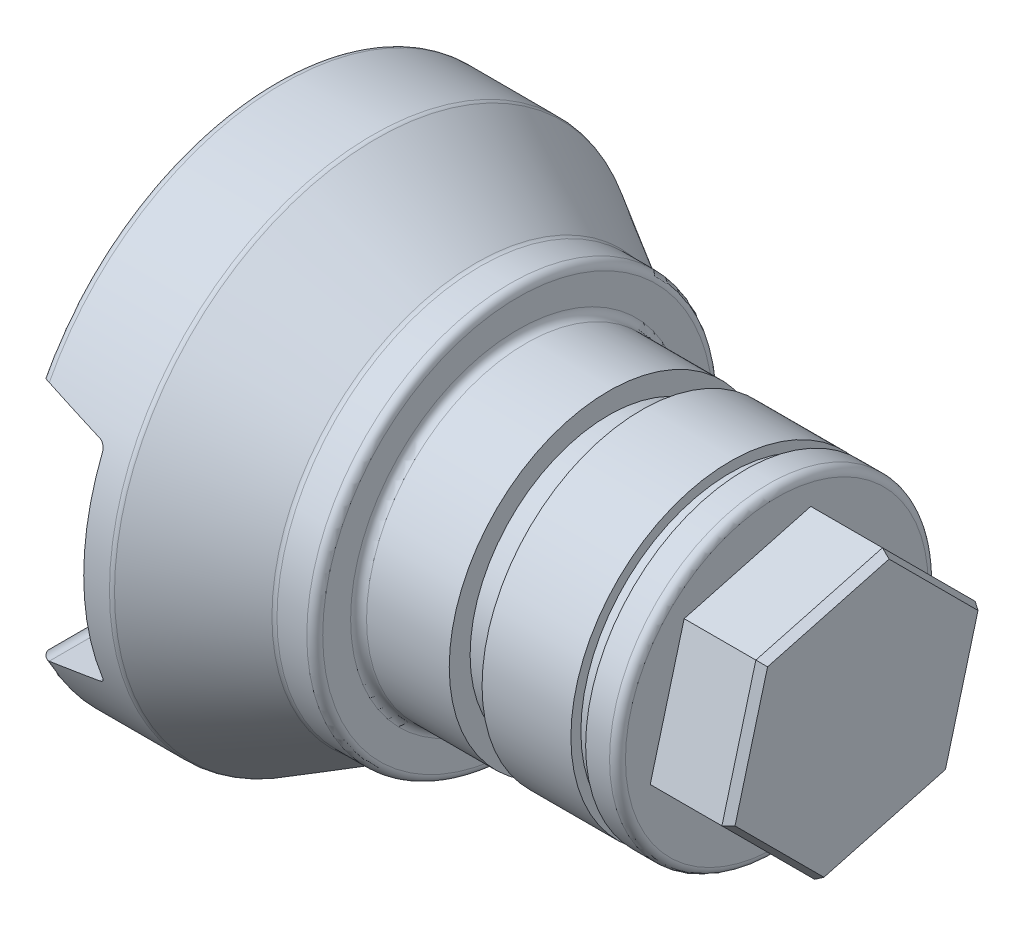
ISO-10303-21;
HEADER;
FILE_DESCRIPTION(('STEP AP214'),'2;1');
FILE_NAME('part.step','',(''),(''),'','','');
FILE_SCHEMA(('AUTOMOTIVE_DESIGN { 1 0 10303 214 1 1 1 1 }'));
ENDSEC;
DATA;
#1=APPLICATION_CONTEXT('core data for automotive mechanical design processes');
#2=APPLICATION_PROTOCOL_DEFINITION('international standard','automotive_design',2000,#1);
#3=PRODUCT_CONTEXT('',#1,'mechanical');
#4=PRODUCT('Part','Part','',(#3));
#5=PRODUCT_RELATED_PRODUCT_CATEGORY('part','',(#4));
#6=PRODUCT_DEFINITION_FORMATION('','',#4);
#7=PRODUCT_DEFINITION_CONTEXT('part definition',#1,'design');
#8=PRODUCT_DEFINITION('design','',#6,#7);
#9=PRODUCT_DEFINITION_SHAPE('','',#8);
#10=(LENGTH_UNIT() NAMED_UNIT(*) SI_UNIT(.MILLI.,.METRE.));
#11=(NAMED_UNIT(*) PLANE_ANGLE_UNIT() SI_UNIT($,.RADIAN.));
#12=(NAMED_UNIT(*) SI_UNIT($,.STERADIAN.) SOLID_ANGLE_UNIT());
#13=UNCERTAINTY_MEASURE_WITH_UNIT(LENGTH_MEASURE(1.E-05),#10,'distance_accuracy_value','');
#14=(GEOMETRIC_REPRESENTATION_CONTEXT(3) GLOBAL_UNCERTAINTY_ASSIGNED_CONTEXT((#13)) GLOBAL_UNIT_ASSIGNED_CONTEXT((#10,
#11,#12)) REPRESENTATION_CONTEXT('',''));
#15=CARTESIAN_POINT('',(0.,0.,0.));
#16=DIRECTION('',(0.,0.,1.));
#17=DIRECTION('',(1.,0.,0.));
#18=AXIS2_PLACEMENT_3D('',#15,#16,#17);
#19=CARTESIAN_POINT('',(-7.00000000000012,19.,0.));
#20=DIRECTION('',(-1.,0.,0.));
#21=DIRECTION('',(0.,0.,1.));
#22=AXIS2_PLACEMENT_3D('',#19,#20,#21);
#23=PLANE('',#22);
#24=CARTESIAN_POINT('',(-7.00000000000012,1.11022302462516E-13,0.));
#25=DIRECTION('',(-1.,0.,0.));
#26=DIRECTION('',(0.,0.,1.));
#27=AXIS2_PLACEMENT_3D('',#24,#25,#26);
#28=CIRCLE('',#27,19.);
#29=CARTESIAN_POINT('',(-7.00000000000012,1.10346627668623E-13,18.9999999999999));
#30=VERTEX_POINT('',#29);
#31=EDGE_CURVE('E502',#30,#30,#28,.T.);
#32=ORIENTED_EDGE('',*,*,#31,.F.);
#33=EDGE_LOOP('',(#32));
#34=FACE_BOUND('',#33,.T.);
#35=DIRECTION('',(0.,0.258819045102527,-0.965925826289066));
#36=VECTOR('',#35,1.);
#37=CARTESIAN_POINT('',(-6.99999999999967,-15.8938097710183,4.25873349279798));
#38=LINE('',#37,#36);
#39=CARTESIAN_POINT('',(-6.99999999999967,-15.8938097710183,4.25873349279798));
#40=VERTEX_POINT('',#39);
#41=CARTESIAN_POINT('',(-6.9999999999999,-11.6350762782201,-11.6350762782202));
#42=VERTEX_POINT('',#41);
#43=EDGE_CURVE('E213',#40,#42,#38,.T.);
#44=ORIENTED_EDGE('',*,*,#43,.F.);
#45=DIRECTION('',(0.,-0.707106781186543,-0.707106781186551));
#46=VECTOR('',#45,1.);
#47=CARTESIAN_POINT('',(-7.00000000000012,-4.25873349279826,15.8938097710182));
#48=LINE('',#47,#46);
#49=CARTESIAN_POINT('',(-7.00000000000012,-4.25873349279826,15.8938097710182));
#50=VERTEX_POINT('',#49);
#51=EDGE_CURVE('E217',#50,#40,#48,.T.);
#52=ORIENTED_EDGE('',*,*,#51,.F.);
#53=DIRECTION('',(0.,-0.96592582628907,0.258819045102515));
#54=VECTOR('',#53,1.);
#55=CARTESIAN_POINT('',(-7.00000000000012,11.6350762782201,11.6350762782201));
#56=LINE('',#55,#54);
#57=CARTESIAN_POINT('',(-7.00000000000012,11.6350762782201,11.6350762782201));
#58=VERTEX_POINT('',#57);
#59=EDGE_CURVE('E230',#58,#50,#56,.T.);
#60=ORIENTED_EDGE('',*,*,#59,.F.);
#61=DIRECTION('',(0.,-0.258819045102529,0.965925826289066));
#62=VECTOR('',#61,1.);
#63=CARTESIAN_POINT('',(-7.00000000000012,15.8938097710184,-4.25873349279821));
#64=LINE('',#63,#62);
#65=CARTESIAN_POINT('',(-7.00000000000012,15.8938097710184,-4.25873349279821));
#66=VERTEX_POINT('',#65);
#67=EDGE_CURVE('E232',#66,#58,#64,.T.);
#68=ORIENTED_EDGE('',*,*,#67,.F.);
#69=DIRECTION('',(0.,0.707106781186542,0.707106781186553));
#70=VECTOR('',#69,1.);
#71=CARTESIAN_POINT('',(-6.9999999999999,4.25873349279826,-15.8938097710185));
#72=LINE('',#71,#70);
#73=CARTESIAN_POINT('',(-6.9999999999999,4.25873349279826,-15.8938097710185));
#74=VERTEX_POINT('',#73);
#75=EDGE_CURVE('E877',#74,#66,#72,.T.);
#76=ORIENTED_EDGE('',*,*,#75,.F.);
#77=DIRECTION('',(0.,0.96592582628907,-0.258819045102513));
#78=VECTOR('',#77,1.);
#79=CARTESIAN_POINT('',(-6.9999999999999,-11.6350762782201,-11.6350762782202));
#80=LINE('',#79,#78);
#81=EDGE_CURVE('E226',#42,#74,#80,.T.);
#82=ORIENTED_EDGE('',*,*,#81,.F.);
#83=EDGE_LOOP('',(#44,#52,#60,#68,#76,#82));
#84=FACE_BOUND('',#83,.T.);
#85=ADVANCED_FACE('F34',(#34,#84),#23,.F.);
#86=CARTESIAN_POINT('',(-69.9999999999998,32.0000000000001,0.));
#87=DIRECTION('',(1.,0.,0.));
#88=DIRECTION('',(0.,0.,-1.));
#89=AXIS2_PLACEMENT_3D('',#86,#87,#88);
#90=PLANE('',#89);
#91=CARTESIAN_POINT('',(-70.0000000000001,1.11022302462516E-13,0.));
#92=DIRECTION('',(-1.,0.,0.));
#93=DIRECTION('',(0.,0.,1.));
#94=AXIS2_PLACEMENT_3D('',#91,#92,#93);
#95=CIRCLE('',#94,32.);
#96=CARTESIAN_POINT('',(-70.0000000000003,-14.8619669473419,-28.3394061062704));
#97=VERTEX_POINT('',#96);
#98=CARTESIAN_POINT('',(-69.9999999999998,-14.8619669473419,28.3394061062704));
#99=VERTEX_POINT('',#98);
#100=EDGE_CURVE('E442',#97,#99,#95,.T.);
#101=ORIENTED_EDGE('',*,*,#100,.T.);
#102=DIRECTION('',(0.,0.,1.));
#103=VECTOR('',#102,1.);
#104=CARTESIAN_POINT('',(-70.0000000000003,-14.8619669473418,-33.));
#105=LINE('',#104,#103);
#106=CARTESIAN_POINT('',(-69.9999999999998,-14.8619669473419,18.2036243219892));
#107=VERTEX_POINT('',#106);
#108=EDGE_CURVE('E548',#99,#107,#105,.F.);
#109=ORIENTED_EDGE('',*,*,#108,.T.);
#110=CARTESIAN_POINT('',(-70.0000000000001,1.11022302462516E-13,0.));
#111=DIRECTION('',(-1.,0.,0.));
#112=DIRECTION('',(0.,0.,1.));
#113=AXIS2_PLACEMENT_3D('',#110,#111,#112);
#114=CIRCLE('',#113,23.5);
#115=CARTESIAN_POINT('',(-69.9999999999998,-14.8619669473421,-18.2036243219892));
#116=VERTEX_POINT('',#115);
#117=EDGE_CURVE('E525',#116,#107,#114,.T.);
#118=ORIENTED_EDGE('',*,*,#117,.F.);
#119=EDGE_CURVE('E546',#116,#97,#105,.F.);
#120=ORIENTED_EDGE('',*,*,#119,.T.);
#121=EDGE_LOOP('',(#101,#109,#118,#120));
#122=FACE_BOUND('',#121,.T.);
#123=ADVANCED_FACE('F545',(#122),#90,.F.);
#124=CARTESIAN_POINT('',(-68.9999999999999,-1.11022302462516E-13,0.));
#125=DIRECTION('',(-1.,0.,0.));
#126=DIRECTION('',(0.,0.,1.));
#127=AXIS2_PLACEMENT_3D('',#124,#125,#126);
#128=TOROIDAL_SURFACE('',#127,32.,1.);
#129=CARTESIAN_POINT('',(-68.9999999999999,-1.11022302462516E-13,0.));
#130=DIRECTION('',(-1.,0.,0.));
#131=DIRECTION('',(0.,0.,1.));
#132=AXIS2_PLACEMENT_3D('',#129,#130,#131);
#133=CIRCLE('',#132,33.);
#134=CARTESIAN_POINT('',(-68.9999999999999,-15.1435935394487,-29.3201564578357));
#135=VERTEX_POINT('',#134);
#136=CARTESIAN_POINT('',(-68.9999999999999,-15.1435935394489,29.3201564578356));
#137=VERTEX_POINT('',#136);
#138=EDGE_CURVE('E446',#135,#137,#133,.T.);
#139=ORIENTED_EDGE('',*,*,#138,.T.);
#140=CARTESIAN_POINT('',(-68.9998000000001,-15.1435399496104,29.3201841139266));
#141=CARTESIAN_POINT('',(-69.001464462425,-15.1439859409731,29.3199541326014));
#142=CARTESIAN_POINT('',(-69.0031283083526,-15.1444317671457,29.3197195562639));
#143=CARTESIAN_POINT('',(-69.006454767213,-15.1453230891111,29.3192412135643));
#144=CARTESIAN_POINT('',(-69.0081173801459,-15.1457685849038,29.3189974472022));
#145=CARTESIAN_POINT('',(-69.0097793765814,-15.1462139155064,29.3187490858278));
#146=B_SPLINE_CURVE_WITH_KNOTS('',3,(#140,#141,#142,#143,#144,#145),.UNSPECIFIED.,.F.,.F.,(4,2,
4),(0.,0.00521531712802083,0.0104306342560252),.UNSPECIFIED.);
#147=CARTESIAN_POINT('',(-69.0095793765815,-15.1461603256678,29.3187789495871));
#148=VERTEX_POINT('',#147);
#149=EDGE_CURVE('E371',#137,#148,#146,.T.);
#150=ORIENTED_EDGE('',*,*,#149,.T.);
#151=CARTESIAN_POINT('',(-69.0093793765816,-15.1461067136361,29.3188087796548));
#152=CARTESIAN_POINT('',(-69.0338304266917,-15.1526657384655,29.3151644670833));
#153=CARTESIAN_POINT('',(-69.0584471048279,-15.1582691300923,29.3109942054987));
#154=CARTESIAN_POINT('',(-69.1078208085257,-15.1675772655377,29.3015404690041));
#155=CARTESIAN_POINT('',(-69.1325778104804,-15.1712823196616,29.2962571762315));
#156=CARTESIAN_POINT('',(-69.2065673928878,-15.1795473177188,29.278695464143));
#157=CARTESIAN_POINT('',(-69.255737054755,-15.1813145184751,29.2646741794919));
#158=CARTESIAN_POINT('',(-69.3521524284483,-15.1778905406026,29.2318017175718));
#159=CARTESIAN_POINT('',(-69.3993977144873,-15.1726978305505,29.2129494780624));
#160=CARTESIAN_POINT('',(-69.4905553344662,-15.1563444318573,29.1704042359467));
#161=CARTESIAN_POINT('',(-69.5344669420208,-15.1451824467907,29.1467101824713));
#162=CARTESIAN_POINT('',(-69.6189874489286,-15.1178466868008,29.0937785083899));
#163=CARTESIAN_POINT('',(-69.6594638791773,-15.1015371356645,29.0644002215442));
#164=CARTESIAN_POINT('',(-69.7347063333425,-15.0658383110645,29.0005184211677));
#165=CARTESIAN_POINT('',(-69.7694631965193,-15.0464441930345,28.9660068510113));
#166=CARTESIAN_POINT('',(-69.8346495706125,-15.0054275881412,28.8890549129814));
#167=CARTESIAN_POINT('',(-69.864582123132,-14.9837455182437,28.8462209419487));
#168=CARTESIAN_POINT('',(-69.9157683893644,-14.9431123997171,28.7545760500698));
#169=CARTESIAN_POINT('',(-69.9370491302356,-14.924152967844,28.705784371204));
#170=CARTESIAN_POINT('',(-69.9684880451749,-14.8945866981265,28.6088050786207));
#171=CARTESIAN_POINT('',(-69.9796175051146,-14.8832870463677,28.5611497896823));
#172=CARTESIAN_POINT('',(-69.994765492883,-14.867630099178,28.4636424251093));
#173=CARTESIAN_POINT('',(-69.9987830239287,-14.8632737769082,28.4137900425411));
#174=CARTESIAN_POINT('',(-70.0008797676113,-14.8610216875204,28.3069452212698));
#175=CARTESIAN_POINT('',(-69.9980511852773,-14.8641132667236,28.2499280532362));
#176=CARTESIAN_POINT('',(-69.9862053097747,-14.8765225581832,28.1371221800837));
#177=CARTESIAN_POINT('',(-69.9771603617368,-14.8858680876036,28.0813401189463));
#178=CARTESIAN_POINT('',(-69.9558230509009,-14.9066169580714,27.9806792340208));
#179=CARTESIAN_POINT('',(-69.9443004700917,-14.9174364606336,27.9355054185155));
#180=CARTESIAN_POINT('',(-69.9179041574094,-14.9407956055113,27.8465714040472));
#181=CARTESIAN_POINT('',(-69.90302775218,-14.9533366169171,27.8028123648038));
#182=CARTESIAN_POINT('',(-69.869983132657,-14.9793202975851,27.7168835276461));
#183=CARTESIAN_POINT('',(-69.8518178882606,-14.9927621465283,27.6747123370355));
#184=CARTESIAN_POINT('',(-69.8120526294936,-15.0198887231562,27.5921394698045));
#185=CARTESIAN_POINT('',(-69.790455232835,-15.0335732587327,27.5517364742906));
#186=CARTESIAN_POINT('',(-69.7393574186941,-15.0629670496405,27.4660391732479));
#187=CARTESIAN_POINT('',(-69.7091347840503,-15.0786058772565,27.421145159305));
#188=CARTESIAN_POINT('',(-69.6427867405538,-15.1082178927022,27.3353334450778));
#189=CARTESIAN_POINT('',(-69.6066710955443,-15.1221937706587,27.2944093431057));
#190=CARTESIAN_POINT('',(-69.5387207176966,-15.1434648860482,27.229077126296));
#191=CARTESIAN_POINT('',(-69.5085092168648,-15.1515356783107,27.2032491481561));
#192=CARTESIAN_POINT('',(-69.4443831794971,-15.1651706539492,27.1558640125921));
#193=CARTESIAN_POINT('',(-69.4104760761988,-15.1707397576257,27.1342985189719));
#194=CARTESIAN_POINT('',(-69.3475961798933,-15.1774690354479,27.1014002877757));
#195=CARTESIAN_POINT('',(-69.3193438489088,-15.1793589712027,27.0888537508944));
#196=CARTESIAN_POINT('',(-69.2612920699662,-15.1806295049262,27.0679539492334));
#197=CARTESIAN_POINT('',(-69.2314950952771,-15.1800139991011,27.0595941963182));
#198=CARTESIAN_POINT('',(-69.1694963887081,-15.1758394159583,27.0473322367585));
#199=CARTESIAN_POINT('',(-69.1372510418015,-15.1721255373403,27.0436907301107));
#200=CARTESIAN_POINT('',(-69.0890589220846,-15.1641597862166,27.0423060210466));
#201=CARTESIAN_POINT('',(-69.0729423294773,-15.1610834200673,27.042535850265));
#202=CARTESIAN_POINT('',(-69.0409498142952,-15.1541621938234,27.0443233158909));
#203=CARTESIAN_POINT('',(-69.0250738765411,-15.1503173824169,27.0458808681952));
#204=CARTESIAN_POINT('',(-69.0093793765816,-15.1461067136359,27.0480716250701));
#205=B_SPLINE_CURVE_WITH_KNOTS('',3,(#151,#152,#153,#154,#155,#156,#157,#158,#159,#160,#161,
#162,#163,#164,#165,#166,#167,#168,#169,#170,#171,#172,#173,#174,#175,#176,#177,#178,#179,#180,
#181,#182,#183,#184,#185,#186,#187,#188,#189,#190,#191,#192,#193,#194,#195,#196,#197,#198,#199,
#200,#201,#202,#203,#204),.UNSPECIFIED.,.F.,.F.,(4,2,2,2,2,2,2,2,2,2,2,2,2,2,2,2,2,2,2,2,2,2,2,
2,2,2,4),(0.,0.0766820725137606,0.153351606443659,0.30601572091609,0.458713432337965,
0.611444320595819,0.768598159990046,0.926001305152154,1.09482515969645,1.26311750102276,
1.41275880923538,1.56242108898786,1.73298706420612,1.90431679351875,2.04771595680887,
2.19122983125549,2.33461474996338,2.47789082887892,2.64653085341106,2.81489425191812,
2.93621719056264,3.05730045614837,3.14984672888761,3.24224913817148,3.33956560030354,
3.38872874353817,3.43788877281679),.UNSPECIFIED.);
#206=EDGE_CURVE('E366',#148,#99,#205,.T.);
#207=ORIENTED_EDGE('',*,*,#206,.T.);
#208=ORIENTED_EDGE('',*,*,#100,.F.);
#209=CARTESIAN_POINT('',(-69.0093793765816,-15.1461067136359,-27.04807162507));
#210=CARTESIAN_POINT('',(-69.0254457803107,-15.1504174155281,-27.0458285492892));
#211=CARTESIAN_POINT('',(-69.0417028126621,-15.1543444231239,-27.044249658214));
#212=CARTESIAN_POINT('',(-69.074464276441,-15.1613919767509,-27.042484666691));
#213=CARTESIAN_POINT('',(-69.0909687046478,-15.1645125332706,-27.0422985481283));
#214=CARTESIAN_POINT('',(-69.1402733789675,-15.172544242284,-27.0439134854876));
#215=CARTESIAN_POINT('',(-69.1732393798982,-15.1762257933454,-27.0478338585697));
#216=CARTESIAN_POINT('',(-69.2382226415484,-15.1803121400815,-27.0611996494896));
#217=CARTESIAN_POINT('',(-69.2702390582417,-15.180714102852,-27.0706498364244));
#218=CARTESIAN_POINT('',(-69.3323920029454,-15.178671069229,-27.0943046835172));
#219=CARTESIAN_POINT('',(-69.3625245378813,-15.176220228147,-27.1085190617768));
#220=CARTESIAN_POINT('',(-69.429539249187,-15.167913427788,-27.1458282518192));
#221=CARTESIAN_POINT('',(-69.4655353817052,-15.1612246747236,-27.1703097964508));
#222=CARTESIAN_POINT('',(-69.5332140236,-15.145163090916,-27.2239041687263));
#223=CARTESIAN_POINT('',(-69.5648856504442,-15.1357836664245,-27.253028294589));
#224=CARTESIAN_POINT('',(-69.6433614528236,-15.1087161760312,-27.3343701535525));
#225=CARTESIAN_POINT('',(-69.6867544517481,-15.0895704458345,-27.3893694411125));
#226=CARTESIAN_POINT('',(-69.7644880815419,-15.0496028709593,-27.5048195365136));
#227=CARTESIAN_POINT('',(-69.7988063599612,-15.0287770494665,-27.5652833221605));
#228=CARTESIAN_POINT('',(-69.8620663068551,-14.985917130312,-27.695348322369));
#229=CARTESIAN_POINT('',(-69.8903357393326,-14.9639241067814,-27.7652922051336));
#230=CARTESIAN_POINT('',(-69.9260895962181,-14.9336836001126,-27.8730882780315));
#231=CARTESIAN_POINT('',(-69.9368968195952,-14.9240641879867,-27.9094884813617));
#232=CARTESIAN_POINT('',(-69.956207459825,-14.9062449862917,-27.983228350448));
#233=CARTESIAN_POINT('',(-69.9647118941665,-14.8980445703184,-28.0205675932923));
#234=CARTESIAN_POINT('',(-69.981328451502,-14.8815938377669,-28.1070608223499));
#235=CARTESIAN_POINT('',(-69.9886177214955,-14.8740132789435,-28.1565121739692));
#236=CARTESIAN_POINT('',(-69.9982445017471,-14.863884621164,-28.2563877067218));
#237=CARTESIAN_POINT('',(-70.0005917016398,-14.861326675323,-28.3068097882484));
#238=CARTESIAN_POINT('',(-69.999147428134,-14.8628872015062,-28.4083299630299));
#239=CARTESIAN_POINT('',(-69.9952638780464,-14.8671058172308,-28.4594269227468));
#240=CARTESIAN_POINT('',(-69.9800459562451,-14.8828524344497,-28.5593362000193));
#241=CARTESIAN_POINT('',(-69.9687175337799,-14.894374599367,-28.6081503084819));
#242=CARTESIAN_POINT('',(-69.9407740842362,-14.9206468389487,-28.6942485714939));
#243=CARTESIAN_POINT('',(-69.9252579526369,-14.9346141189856,-28.7321440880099));
#244=CARTESIAN_POINT('',(-69.8890559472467,-14.9646694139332,-28.8044874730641));
#245=CARTESIAN_POINT('',(-69.8683640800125,-14.9807598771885,-28.8389312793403));
#246=CARTESIAN_POINT('',(-69.8197911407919,-15.0150630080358,-28.9077102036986));
#247=CARTESIAN_POINT('',(-69.7913808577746,-15.0333199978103,-28.9416477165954));
#248=CARTESIAN_POINT('',(-69.729367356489,-15.068366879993,-29.0052591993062));
#249=CARTESIAN_POINT('',(-69.6957628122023,-15.0851563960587,-29.0349320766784));
#250=CARTESIAN_POINT('',(-69.6179888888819,-15.1182403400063,-29.0947100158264));
#251=CARTESIAN_POINT('',(-69.5729926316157,-15.133981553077,-29.1240561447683));
#252=CARTESIAN_POINT('',(-69.4780892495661,-15.1592344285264,-29.1769985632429));
#253=CARTESIAN_POINT('',(-69.4281807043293,-15.1687442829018,-29.2005931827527));
#254=CARTESIAN_POINT('',(-69.3266905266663,-15.1798006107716,-29.2413545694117));
#255=CARTESIAN_POINT('',(-69.275202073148,-15.1815743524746,-29.2586908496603));
#256=CARTESIAN_POINT('',(-69.1711660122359,-15.1768492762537,-29.2879539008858));
#257=CARTESIAN_POINT('',(-69.1186211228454,-15.1703695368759,-29.2998930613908));
#258=CARTESIAN_POINT('',(-69.0474199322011,-15.1557135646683,-29.3128398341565));
#259=CARTESIAN_POINT('',(-69.0283396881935,-15.1511994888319,-29.3159866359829));
#260=CARTESIAN_POINT('',(-69.0093793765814,-15.146106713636,-29.3188087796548));
#261=B_SPLINE_CURVE_WITH_KNOTS('',3,(#209,#210,#211,#212,#213,#214,#215,#216,#217,#218,#219,
#220,#221,#222,#223,#224,#225,#226,#227,#228,#229,#230,#231,#232,#233,#234,#235,#236,#237,#238,
#239,#240,#241,#242,#243,#244,#245,#246,#247,#248,#249,#250,#251,#252,#253,#254,#255,#256,#257,
#258,#259,#260),.UNSPECIFIED.,.F.,.F.,(4,2,2,2,2,2,2,2,2,2,2,2,2,2,2,2,2,2,2,2,2,2,2,2,2,4),(0.,
0.0503246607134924,0.100648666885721,0.200143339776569,0.299723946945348,0.399508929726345,
0.530907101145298,0.662630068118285,0.879291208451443,1.09648114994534,1.33149246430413,
1.44892451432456,1.56630459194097,1.71758928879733,1.86857709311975,2.02181678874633,
2.17493417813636,2.30419135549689,2.43359890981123,2.57670747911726,2.71985264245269,
2.88695675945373,3.0541093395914,3.21631681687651,3.37815001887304,3.43767501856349),.UNSPECIFIED.);
#262=CARTESIAN_POINT('',(-69.0095793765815,-15.146160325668,-29.3187789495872));
#263=VERTEX_POINT('',#262);
#264=EDGE_CURVE('E328',#97,#263,#261,.T.);
#265=ORIENTED_EDGE('',*,*,#264,.T.);
#266=CARTESIAN_POINT('',(-69.0097793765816,-15.1462139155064,-29.318749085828));
#267=CARTESIAN_POINT('',(-69.008117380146,-15.1457685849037,-29.3189974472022));
#268=CARTESIAN_POINT('',(-69.0064547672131,-15.145323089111,-29.3192412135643));
#269=CARTESIAN_POINT('',(-69.0031283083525,-15.1444317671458,-29.3197195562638));
#270=CARTESIAN_POINT('',(-69.0014644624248,-15.1439859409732,-29.3199541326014));
#271=CARTESIAN_POINT('',(-68.9997999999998,-15.1435399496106,-29.3201841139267));
#272=B_SPLINE_CURVE_WITH_KNOTS('',3,(#266,#267,#268,#269,#270,#271),.UNSPECIFIED.,.F.,.F.,(4,2,
4),(0.,0.00521531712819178,0.0104306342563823),.UNSPECIFIED.);
#273=EDGE_CURVE('E361',#263,#135,#272,.T.);
#274=ORIENTED_EDGE('',*,*,#273,.T.);
#275=EDGE_LOOP('',(#139,#150,#207,#208,#265,#274));
#276=FACE_BOUND('',#275,.T.);
#277=ADVANCED_FACE('F343',(#276),#128,.T.);
#278=CARTESIAN_POINT('',(-70.0000000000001,14.8619669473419,28.3394061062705));
#279=VERTEX_POINT('',#278);
#280=CARTESIAN_POINT('',(-70.0000000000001,14.8619669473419,-28.3394061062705));
#281=VERTEX_POINT('',#280);
#282=EDGE_CURVE('E443',#279,#281,#95,.T.);
#283=ORIENTED_EDGE('',*,*,#282,.T.);
#284=DIRECTION('',(0.,0.,1.));
#285=VECTOR('',#284,1.);
#286=CARTESIAN_POINT('',(-70.0000000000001,14.8619669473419,-33.));
#287=LINE('',#286,#285);
#288=CARTESIAN_POINT('',(-70.0000000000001,14.8619669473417,-18.2036243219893));
#289=VERTEX_POINT('',#288);
#290=EDGE_CURVE('E277',#281,#289,#287,.T.);
#291=ORIENTED_EDGE('',*,*,#290,.T.);
#292=CARTESIAN_POINT('',(-69.9999999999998,14.8619669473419,18.2036243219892));
#293=VERTEX_POINT('',#292);
#294=EDGE_CURVE('E526',#293,#289,#114,.T.);
#295=ORIENTED_EDGE('',*,*,#294,.F.);
#296=EDGE_CURVE('E281',#293,#279,#287,.T.);
#297=ORIENTED_EDGE('',*,*,#296,.T.);
#298=EDGE_LOOP('',(#283,#291,#295,#297));
#299=FACE_BOUND('',#298,.T.);
#300=ADVANCED_FACE('F36',(#299),#90,.F.);
#301=CARTESIAN_POINT('',(40.,1.11022302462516E-13,0.));
#302=DIRECTION('',(-1.,0.,0.));
#303=DIRECTION('',(0.,0.,1.));
#304=AXIS2_PLACEMENT_3D('',#301,#302,#303);
#305=CYLINDRICAL_SURFACE('',#304,23.5);
#306=CARTESIAN_POINT('',(-12.4833395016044,1.11022302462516E-13,0.));
#307=DIRECTION('',(0.25881904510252,-0.965925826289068,0.));
#308=DIRECTION('',(-0.965925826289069,-0.25881904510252,0.));
#309=AXIS2_PLACEMENT_3D('',#306,#307,#308);
#310=ELLIPSE('',#309,90.7970276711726,23.5);
#311=CARTESIAN_POINT('',(-61.7411809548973,-13.1985988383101,-19.4434304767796));
#312=VERTEX_POINT('',#311);
#313=CARTESIAN_POINT('',(-69.0095793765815,-15.146160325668,-17.9678553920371));
#314=VERTEX_POINT('',#313);
#315=EDGE_CURVE('E419',#312,#314,#310,.F.);
#316=ORIENTED_EDGE('',*,*,#315,.T.);
#317=CARTESIAN_POINT('',(-69.0095793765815,-15.146160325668,-17.9678553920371));
#318=CARTESIAN_POINT('',(-69.0303785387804,-15.1517343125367,-17.9631566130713));
#319=CARTESIAN_POINT('',(-69.051465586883,-15.1566628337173,-17.9589978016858));
#320=CARTESIAN_POINT('',(-69.09410582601,-15.1651686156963,-17.9518158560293));
#321=CARTESIAN_POINT('',(-69.1156591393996,-15.1687455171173,-17.948793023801));
#322=CARTESIAN_POINT('',(-69.1807230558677,-15.1773392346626,-17.9415282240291));
#323=CARTESIAN_POINT('',(-69.2247480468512,-15.1802489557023,-17.9390647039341));
#324=CARTESIAN_POINT('',(-69.3128621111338,-15.1802198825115,-17.9390892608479));
#325=CARTESIAN_POINT('',(-69.3569511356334,-15.1772693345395,-17.9415872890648));
#326=CARTESIAN_POINT('',(-69.4437855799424,-15.165707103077,-17.9513616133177));
#327=CARTESIAN_POINT('',(-69.4865321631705,-15.1571004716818,-17.9586336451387));
#328=CARTESIAN_POINT('',(-69.5693952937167,-15.1348196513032,-17.9774147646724));
#329=CARTESIAN_POINT('',(-69.609525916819,-15.1211757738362,-17.9888985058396));
#330=CARTESIAN_POINT('',(-69.6868141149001,-15.0894538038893,-18.0155159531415));
#331=CARTESIAN_POINT('',(-69.7239631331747,-15.0713635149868,-18.0306596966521));
#332=CARTESIAN_POINT('',(-69.8058858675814,-15.0251962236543,-18.0691623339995));
#333=CARTESIAN_POINT('',(-69.8493797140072,-14.9957680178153,-18.0936067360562));
#334=CARTESIAN_POINT('',(-69.9296743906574,-14.9321182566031,-18.1461728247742));
#335=CARTESIAN_POINT('',(-69.9665158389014,-14.8979282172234,-18.1742702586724));
#336=CARTESIAN_POINT('',(-69.9999999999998,-14.8619669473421,-18.2036243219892));
#337=B_SPLINE_CURVE_WITH_KNOTS('',3,(#317,#318,#319,#320,#321,#322,#323,#324,#325,#326,#327,
#328,#329,#330,#331,#332,#333,#334,#335,#336),.UNSPECIFIED.,.F.,.F.,(4,2,2,2,2,2,2,2,2,4),(0.,
0.0660858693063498,0.13218929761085,0.264049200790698,0.396173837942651,0.528180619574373,
0.659405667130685,0.790994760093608,0.96399718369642,1.13590467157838),.UNSPECIFIED.);
#338=EDGE_CURVE('E540',#314,#116,#337,.T.);
#339=ORIENTED_EDGE('',*,*,#338,.T.);
#340=ORIENTED_EDGE('',*,*,#117,.T.);
#341=CARTESIAN_POINT('',(-69.9999999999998,-14.8619669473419,18.2036243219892));
#342=CARTESIAN_POINT('',(-69.9661633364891,-14.8983047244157,18.173963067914));
#343=CARTESIAN_POINT('',(-69.9289033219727,-14.9328326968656,18.1455857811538));
#344=CARTESIAN_POINT('',(-69.8475652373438,-14.9970993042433,18.0925042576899));
#345=CARTESIAN_POINT('',(-69.8034341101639,-15.0267966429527,18.067831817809));
#346=CARTESIAN_POINT('',(-69.7167527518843,-15.0752304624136,18.027430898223));
#347=CARTESIAN_POINT('',(-69.6751465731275,-15.0949672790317,18.0108981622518));
#348=CARTESIAN_POINT('',(-69.5883488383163,-15.1288077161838,17.9824821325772));
#349=CARTESIAN_POINT('',(-69.5431697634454,-15.1429299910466,17.9705834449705));
#350=CARTESIAN_POINT('',(-69.4498551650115,-15.1648078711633,17.9521256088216));
#351=CARTESIAN_POINT('',(-69.4017004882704,-15.1725163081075,17.9456060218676));
#352=CARTESIAN_POINT('',(-69.3042811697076,-15.180783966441,17.9386128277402));
#353=CARTESIAN_POINT('',(-69.2550158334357,-15.181338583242,17.9381431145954));
#354=CARTESIAN_POINT('',(-69.1726504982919,-15.1762088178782,17.9424828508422));
#355=CARTESIAN_POINT('',(-69.1393235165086,-15.1724254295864,17.9456838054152));
#356=CARTESIAN_POINT('',(-69.0736267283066,-15.1616502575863,17.9547876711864));
#357=CARTESIAN_POINT('',(-69.0412553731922,-15.1546640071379,17.960685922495));
#358=CARTESIAN_POINT('',(-69.0095793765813,-15.1461603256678,17.9678553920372));
#359=B_SPLINE_CURVE_WITH_KNOTS('',3,(#341,#342,#343,#344,#345,#346,#347,#348,#349,#350,#351,
#352,#353,#354,#355,#356,#357,#358),.UNSPECIFIED.,.F.,.F.,(4,2,2,2,2,2,2,2,4),(0.,
0.17370138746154,0.348817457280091,0.494993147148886,0.640679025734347,0.787427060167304,
0.934269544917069,1.0350874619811,1.13573185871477),.UNSPECIFIED.);
#360=CARTESIAN_POINT('',(-69.0095793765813,-15.1461603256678,17.9678553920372));
#361=VERTEX_POINT('',#360);
#362=EDGE_CURVE('E539',#107,#361,#359,.T.);
#363=ORIENTED_EDGE('',*,*,#362,.T.);
#364=CARTESIAN_POINT('',(-61.7411809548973,-13.1985988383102,19.4434304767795));
#365=VERTEX_POINT('',#364);
#366=EDGE_CURVE('E418',#361,#365,#310,.F.);
#367=ORIENTED_EDGE('',*,*,#366,.T.);
#368=CARTESIAN_POINT('',(-61.7411809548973,-13.1985988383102,19.4434304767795));
#369=CARTESIAN_POINT('',(-61.7149285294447,-13.1915663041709,19.4482040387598));
#370=CARTESIAN_POINT('',(-61.6891033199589,-13.1834971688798,19.4536762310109));
#371=CARTESIAN_POINT('',(-61.6384818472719,-13.1654247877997,19.4659115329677));
#372=CARTESIAN_POINT('',(-61.6136846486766,-13.1554233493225,19.4726734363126));
#373=CARTESIAN_POINT('',(-61.5413730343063,-13.1228632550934,19.4946438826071));
#374=CARTESIAN_POINT('',(-61.4955565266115,-13.0976436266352,19.5116089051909));
#375=CARTESIAN_POINT('',(-61.4096393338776,-13.0414418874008,19.549218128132));
#376=CARTESIAN_POINT('',(-61.3695194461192,-13.0104799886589,19.5698494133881));
#377=CARTESIAN_POINT('',(-61.2951692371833,-12.9438064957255,19.6140122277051));
#378=CARTESIAN_POINT('',(-61.2609489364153,-12.9080869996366,19.637548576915));
#379=CARTESIAN_POINT('',(-61.1948149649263,-12.828231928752,19.6898199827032));
#380=CARTESIAN_POINT('',(-61.1637229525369,-12.7836023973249,19.7188372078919));
#381=CARTESIAN_POINT('',(-61.1095078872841,-12.6908364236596,19.7786686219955));
#382=CARTESIAN_POINT('',(-61.0863905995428,-12.6426974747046,19.8094840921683));
#383=CARTESIAN_POINT('',(-61.044948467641,-12.5355216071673,19.8775083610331));
#384=CARTESIAN_POINT('',(-61.0281165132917,-12.4760276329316,19.914910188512));
#385=CARTESIAN_POINT('',(-61.0056534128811,-12.3552956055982,19.9900442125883));
#386=CARTESIAN_POINT('',(-61.0000042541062,-12.2940605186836,20.02777577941));
#387=CARTESIAN_POINT('',(-60.9999999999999,-12.2326730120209,20.0651865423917));
#388=B_SPLINE_CURVE_WITH_KNOTS('',3,(#368,#369,#370,#371,#372,#373,#374,#375,#376,#377,#378,
#379,#380,#381,#382,#383,#384,#385,#386,#387),.UNSPECIFIED.,.F.,.F.,(4,2,2,2,2,2,2,2,2,4),(0.,
0.082713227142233,0.165349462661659,0.329431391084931,0.492946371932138,0.656736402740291,
0.840979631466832,1.02535577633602,1.24122261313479,1.45674145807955),.UNSPECIFIED.);
#389=CARTESIAN_POINT('',(-60.9999999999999,-12.2326730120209,20.0651865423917));
#390=VERTEX_POINT('',#389);
#391=EDGE_CURVE('E411',#365,#390,#388,.T.);
#392=ORIENTED_EDGE('',*,*,#391,.T.);
#393=CARTESIAN_POINT('',(-60.9999999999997,-1.11022302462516E-13,0.));
#394=DIRECTION('',(1.,0.,0.));
#395=DIRECTION('',(0.,1.,0.));
#396=AXIS2_PLACEMENT_3D('',#393,#394,#395);
#397=CIRCLE('',#396,23.5);
#398=CARTESIAN_POINT('',(-60.9999999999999,12.2326730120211,20.0651865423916));
#399=VERTEX_POINT('',#398);
#400=EDGE_CURVE('E426',#390,#399,#397,.F.);
#401=ORIENTED_EDGE('',*,*,#400,.T.);
#402=CARTESIAN_POINT('',(-60.9999999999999,12.2326730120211,20.0651865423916));
#403=CARTESIAN_POINT('',(-61.0000070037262,12.3052372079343,20.0209753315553));
#404=CARTESIAN_POINT('',(-61.0079007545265,12.3776073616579,19.9762888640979));
#405=CARTESIAN_POINT('',(-61.0393418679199,12.5198716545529,19.8874231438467));
#406=CARTESIAN_POINT('',(-61.0629928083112,12.5897461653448,19.843249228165));
#407=CARTESIAN_POINT('',(-61.1226358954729,12.7170942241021,19.7618498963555));
#408=CARTESIAN_POINT('',(-61.1571325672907,12.7751066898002,19.7243742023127));
#409=CARTESIAN_POINT('',(-61.2384280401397,12.8842972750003,19.6532208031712));
#410=CARTESIAN_POINT('',(-61.2851876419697,12.9354964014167,19.6195314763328));
#411=CARTESIAN_POINT('',(-61.3758416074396,13.0156249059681,19.5664293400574));
#412=CARTESIAN_POINT('',(-61.4169635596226,13.0468002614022,19.5456427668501));
#413=CARTESIAN_POINT('',(-61.5047802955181,13.1029933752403,19.5080163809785));
#414=CARTESIAN_POINT('',(-61.551460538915,13.128026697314,19.4911665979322));
#415=CARTESIAN_POINT('',(-61.6229832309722,13.1592081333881,19.4701151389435));
#416=CARTESIAN_POINT('',(-61.6460365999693,13.1682632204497,19.4639909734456));
#417=CARTESIAN_POINT('',(-61.6929984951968,13.1847070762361,19.4528557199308));
#418=CARTESIAN_POINT('',(-61.7169072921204,13.1920953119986,19.4478449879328));
#419=CARTESIAN_POINT('',(-61.7411809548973,13.1985988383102,19.4434304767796));
#420=B_SPLINE_CURVE_WITH_KNOTS('',3,(#402,#403,#404,#405,#406,#407,#408,#409,#410,#411,#412,
#413,#414,#415,#416,#417,#418,#419),.UNSPECIFIED.,.F.,.F.,(4,2,2,2,2,2,2,2,4),(0.,
0.254708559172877,0.511108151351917,0.741495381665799,0.971154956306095,1.13741590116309,
1.30325109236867,1.37971241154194,1.45619814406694),.UNSPECIFIED.);
#421=CARTESIAN_POINT('',(-61.7411809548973,13.1985988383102,19.4434304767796));
#422=VERTEX_POINT('',#421);
#423=EDGE_CURVE('E430',#399,#422,#420,.T.);
#424=ORIENTED_EDGE('',*,*,#423,.T.);
#425=CARTESIAN_POINT('',(-12.4833395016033,0.,1.25767452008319E-13));
#426=DIRECTION('',(0.258819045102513,0.96592582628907,0.));
#427=DIRECTION('',(-0.965925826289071,0.258819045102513,0.));
#428=AXIS2_PLACEMENT_3D('',#425,#426,#427);
#429=ELLIPSE('',#428,90.7970276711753,23.5);
#430=CARTESIAN_POINT('',(-69.0095793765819,15.146160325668,17.9678553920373));
#431=VERTEX_POINT('',#430);
#432=EDGE_CURVE('E273',#422,#431,#429,.F.);
#433=ORIENTED_EDGE('',*,*,#432,.T.);
#434=CARTESIAN_POINT('',(-69.0095793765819,15.146160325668,17.9678553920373));
#435=CARTESIAN_POINT('',(-69.0303785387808,15.1517343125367,17.9631566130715));
#436=CARTESIAN_POINT('',(-69.0514655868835,15.1566628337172,17.958997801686));
#437=CARTESIAN_POINT('',(-69.0941058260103,15.1651686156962,17.9518158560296));
#438=CARTESIAN_POINT('',(-69.1156591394,15.1687455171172,17.9487930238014));
#439=CARTESIAN_POINT('',(-69.1807230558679,15.1773392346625,17.9415282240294));
#440=CARTESIAN_POINT('',(-69.2247480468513,15.1802489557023,17.9390647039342));
#441=CARTESIAN_POINT('',(-69.3128621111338,15.1802198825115,17.9390892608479));
#442=CARTESIAN_POINT('',(-69.3569511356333,15.1772693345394,17.9415872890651));
#443=CARTESIAN_POINT('',(-69.4437855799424,15.1657071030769,17.951361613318));
#444=CARTESIAN_POINT('',(-69.4865321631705,15.1571004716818,17.9586336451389));
#445=CARTESIAN_POINT('',(-69.5693952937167,15.1348196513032,17.9774147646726));
#446=CARTESIAN_POINT('',(-69.6095259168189,15.1211757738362,17.9888985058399));
#447=CARTESIAN_POINT('',(-69.6868141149,15.0894538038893,18.0155159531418));
#448=CARTESIAN_POINT('',(-69.7239631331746,15.0713635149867,18.0306596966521));
#449=CARTESIAN_POINT('',(-69.8058858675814,15.0251962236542,18.0691623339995));
#450=CARTESIAN_POINT('',(-69.8493797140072,14.9957680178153,18.0936067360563));
#451=CARTESIAN_POINT('',(-69.9296743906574,14.9321182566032,18.1461728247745));
#452=CARTESIAN_POINT('',(-69.9665158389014,14.8979282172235,18.1742702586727));
#453=CARTESIAN_POINT('',(-69.9999999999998,14.8619669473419,18.2036243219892));
#454=B_SPLINE_CURVE_WITH_KNOTS('',3,(#434,#435,#436,#437,#438,#439,#440,#441,#442,#443,#444,
#445,#446,#447,#448,#449,#450,#451,#452,#453),.UNSPECIFIED.,.F.,.F.,(4,2,2,2,2,2,2,2,2,4),(0.,
0.0660858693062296,0.132189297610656,0.264049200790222,0.396173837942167,0.528180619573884,
0.659405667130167,0.790994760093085,0.963997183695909,1.13590467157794),.UNSPECIFIED.);
#455=EDGE_CURVE('E288',#431,#293,#454,.T.);
#456=ORIENTED_EDGE('',*,*,#455,.T.);
#457=ORIENTED_EDGE('',*,*,#294,.T.);
#458=CARTESIAN_POINT('',(-70.0000000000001,14.8619669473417,-18.2036243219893));
#459=CARTESIAN_POINT('',(-69.9661633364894,14.8983047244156,-18.1739630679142));
#460=CARTESIAN_POINT('',(-69.9289033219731,14.9328326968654,-18.145585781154));
#461=CARTESIAN_POINT('',(-69.8475652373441,14.9970993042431,-18.0925042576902));
#462=CARTESIAN_POINT('',(-69.8034341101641,15.0267966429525,-18.0678318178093));
#463=CARTESIAN_POINT('',(-69.7167527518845,15.0752304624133,-18.0274308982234));
#464=CARTESIAN_POINT('',(-69.6751465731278,15.0949672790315,-18.0108981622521));
#465=CARTESIAN_POINT('',(-69.5883488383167,15.1288077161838,-17.9824821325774));
#466=CARTESIAN_POINT('',(-69.5431697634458,15.1429299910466,-17.9705834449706));
#467=CARTESIAN_POINT('',(-69.4498551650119,15.1648078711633,-17.9521256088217));
#468=CARTESIAN_POINT('',(-69.4017004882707,15.1725163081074,-17.9456060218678));
#469=CARTESIAN_POINT('',(-69.3042811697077,15.1807839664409,-17.9386128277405));
#470=CARTESIAN_POINT('',(-69.2550158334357,15.1813385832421,-17.9381431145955));
#471=CARTESIAN_POINT('',(-69.172650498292,15.1762088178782,-17.9424828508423));
#472=CARTESIAN_POINT('',(-69.1393235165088,15.1724254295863,-17.9456838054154));
#473=CARTESIAN_POINT('',(-69.0736267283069,15.1616502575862,-17.9547876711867));
#474=CARTESIAN_POINT('',(-69.0412553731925,15.1546640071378,-17.9606859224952));
#475=CARTESIAN_POINT('',(-69.0095793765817,15.146160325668,-17.9678553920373));
#476=B_SPLINE_CURVE_WITH_KNOTS('',3,(#458,#459,#460,#461,#462,#463,#464,#465,#466,#467,#468,
#469,#470,#471,#472,#473,#474,#475),.UNSPECIFIED.,.F.,.F.,(4,2,2,2,2,2,2,2,4),(0.,
0.173701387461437,0.348817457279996,0.494993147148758,0.640679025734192,0.787427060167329,
0.934269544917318,1.03508746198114,1.13573185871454),.UNSPECIFIED.);
#477=CARTESIAN_POINT('',(-69.0095793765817,15.146160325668,-17.9678553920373));
#478=VERTEX_POINT('',#477);
#479=EDGE_CURVE('E280',#289,#478,#476,.T.);
#480=ORIENTED_EDGE('',*,*,#479,.T.);
#481=CARTESIAN_POINT('',(-61.7411809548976,13.1985988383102,-19.4434304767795));
#482=VERTEX_POINT('',#481);
#483=EDGE_CURVE('E276',#478,#482,#429,.F.);
#484=ORIENTED_EDGE('',*,*,#483,.T.);
#485=CARTESIAN_POINT('',(-61.7411809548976,13.1985988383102,-19.4434304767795));
#486=CARTESIAN_POINT('',(-61.7149285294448,13.1915663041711,-19.4482040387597));
#487=CARTESIAN_POINT('',(-61.6891033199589,13.1834971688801,-19.4536762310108));
#488=CARTESIAN_POINT('',(-61.6384818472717,13.1654247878,-19.4659115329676));
#489=CARTESIAN_POINT('',(-61.6136846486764,13.1554233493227,-19.4726734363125));
#490=CARTESIAN_POINT('',(-61.541373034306,13.1228632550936,-19.494643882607));
#491=CARTESIAN_POINT('',(-61.4955565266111,13.0976436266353,-19.5116089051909));
#492=CARTESIAN_POINT('',(-61.4096393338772,13.0414418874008,-19.5492181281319));
#493=CARTESIAN_POINT('',(-61.3695194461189,13.010479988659,-19.5698494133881));
#494=CARTESIAN_POINT('',(-61.2951692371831,12.9438064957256,-19.6140122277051));
#495=CARTESIAN_POINT('',(-61.2609489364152,12.9080869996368,-19.637548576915));
#496=CARTESIAN_POINT('',(-61.1948149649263,12.8282319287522,-19.6898199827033));
#497=CARTESIAN_POINT('',(-61.1637229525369,12.783602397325,-19.7188372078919));
#498=CARTESIAN_POINT('',(-61.1095078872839,12.6908364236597,-19.7786686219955));
#499=CARTESIAN_POINT('',(-61.0863905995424,12.6426974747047,-19.8094840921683));
#500=CARTESIAN_POINT('',(-61.0449484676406,12.5355216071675,-19.8775083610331));
#501=CARTESIAN_POINT('',(-61.0281165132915,12.4760276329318,-19.914910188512));
#502=CARTESIAN_POINT('',(-61.0056534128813,12.3552956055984,-19.9900442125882));
#503=CARTESIAN_POINT('',(-61.0000042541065,12.2940605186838,-20.0277757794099));
#504=CARTESIAN_POINT('',(-60.9999999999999,12.2326730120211,-20.0651865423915));
#505=B_SPLINE_CURVE_WITH_KNOTS('',3,(#485,#486,#487,#488,#489,#490,#491,#492,#493,#494,#495,
#496,#497,#498,#499,#500,#501,#502,#503,#504),.UNSPECIFIED.,.F.,.F.,(4,2,2,2,2,2,2,2,2,4),(0.,
0.0827132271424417,0.165349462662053,0.329431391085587,0.49294637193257,0.656736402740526,
0.840979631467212,1.0253557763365,1.24122261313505,1.45674145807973),.UNSPECIFIED.);
#506=CARTESIAN_POINT('',(-60.9999999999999,12.2326730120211,-20.0651865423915));
#507=VERTEX_POINT('',#506);
#508=EDGE_CURVE('E436',#482,#507,#505,.T.);
#509=ORIENTED_EDGE('',*,*,#508,.T.);
#510=CARTESIAN_POINT('',(-60.9999999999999,-12.2326730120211,-20.0651865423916));
#511=VERTEX_POINT('',#510);
#512=EDGE_CURVE('E429',#507,#511,#397,.F.);
#513=ORIENTED_EDGE('',*,*,#512,.T.);
#514=CARTESIAN_POINT('',(-60.9999999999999,-12.2326730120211,-20.0651865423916));
#515=CARTESIAN_POINT('',(-61.0000070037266,-12.3052372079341,-20.0209753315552));
#516=CARTESIAN_POINT('',(-61.0079007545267,-12.3776073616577,-19.9762888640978));
#517=CARTESIAN_POINT('',(-61.0393418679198,-12.5198716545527,-19.8874231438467));
#518=CARTESIAN_POINT('',(-61.0629928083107,-12.5897461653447,-19.8432492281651));
#519=CARTESIAN_POINT('',(-61.1226358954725,-12.7170942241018,-19.7618498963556));
#520=CARTESIAN_POINT('',(-61.1571325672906,-12.7751066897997,-19.7243742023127));
#521=CARTESIAN_POINT('',(-61.2384280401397,-12.884297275,-19.6532208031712));
#522=CARTESIAN_POINT('',(-61.2851876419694,-12.9354964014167,-19.6195314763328));
#523=CARTESIAN_POINT('',(-61.3758416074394,-13.015624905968,-19.5664293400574));
#524=CARTESIAN_POINT('',(-61.4169635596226,-13.0468002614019,-19.5456427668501));
#525=CARTESIAN_POINT('',(-61.5047802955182,-13.1029933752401,-19.5080163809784));
#526=CARTESIAN_POINT('',(-61.5514605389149,-13.1280266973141,-19.4911665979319));
#527=CARTESIAN_POINT('',(-61.6229832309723,-13.159208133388,-19.4701151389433));
#528=CARTESIAN_POINT('',(-61.6460365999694,-13.1682632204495,-19.4639909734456));
#529=CARTESIAN_POINT('',(-61.692998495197,-13.1847070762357,-19.4528557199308));
#530=CARTESIAN_POINT('',(-61.7169072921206,-13.1920953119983,-19.4478449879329));
#531=CARTESIAN_POINT('',(-61.7411809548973,-13.1985988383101,-19.4434304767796));
#532=B_SPLINE_CURVE_WITH_KNOTS('',3,(#514,#515,#516,#517,#518,#519,#520,#521,#522,#523,#524,
#525,#526,#527,#528,#529,#530,#531),.UNSPECIFIED.,.F.,.F.,(4,2,2,2,2,2,2,2,4),(0.,
0.254708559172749,0.511108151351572,0.741495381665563,0.971154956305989,1.13741590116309,
1.30325109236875,1.37971241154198,1.45619814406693),.UNSPECIFIED.);
#533=EDGE_CURVE('E417',#511,#312,#532,.T.);
#534=ORIENTED_EDGE('',*,*,#533,.T.);
#535=EDGE_LOOP('',(#316,#339,#340,#363,#367,#392,#401,#424,#433,#456,#457,#480,#484,#509,#513,#534));
#536=FACE_BOUND('',#535,.T.);
#537=CARTESIAN_POINT('',(-57.7679491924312,0.,0.));
#538=DIRECTION('',(-1.,0.,0.));
#539=DIRECTION('',(0.,0.,1.));
#540=AXIS2_PLACEMENT_3D('',#537,#538,#539);
#541=CIRCLE('',#540,23.5);
#542=CARTESIAN_POINT('',(-57.7679491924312,0.,23.5));
#543=VERTEX_POINT('',#542);
#544=EDGE_CURVE('E523',#543,#543,#541,.T.);
#545=ORIENTED_EDGE('',*,*,#544,.F.);
#546=EDGE_LOOP('',(#545));
#547=FACE_BOUND('',#546,.T.);
#548=ADVANCED_FACE('F293',(#536,#547),#305,.F.);
#549=CARTESIAN_POINT('',(-57.7679491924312,0.,0.));
#550=DIRECTION('',(-1.,0.,0.));
#551=DIRECTION('',(0.,0.,1.));
#552=AXIS2_PLACEMENT_3D('',#549,#550,#551);
#553=TOROIDAL_SURFACE('',#552,22.5,1.);
#554=CARTESIAN_POINT('',(-57.2679491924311,-1.11022302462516E-13,0.));
#555=DIRECTION('',(-1.,0.,0.));
#556=DIRECTION('',(0.,0.,1.));
#557=AXIS2_PLACEMENT_3D('',#554,#555,#556);
#558=CIRCLE('',#557,23.3660254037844);
#559=CARTESIAN_POINT('',(-57.2679491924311,-1.11853241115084E-13,23.3660254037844));
#560=VERTEX_POINT('',#559);
#561=EDGE_CURVE('E520',#560,#560,#558,.T.);
#562=ORIENTED_EDGE('',*,*,#561,.F.);
#563=EDGE_LOOP('',(#562));
#564=FACE_BOUND('',#563,.T.);
#565=ORIENTED_EDGE('',*,*,#544,.T.);
#566=EDGE_LOOP('',(#565));
#567=FACE_BOUND('',#566,.T.);
#568=ADVANCED_FACE('F660',(#564,#567),#553,.F.);
#569=CARTESIAN_POINT('',(-57.2679491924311,-1.11022302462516E-13,0.));
#570=DIRECTION('',(-1.,0.,0.));
#571=DIRECTION('',(0.,0.,1.));
#572=AXIS2_PLACEMENT_3D('',#569,#570,#571);
#573=CONICAL_SURFACE('',#572,23.3660254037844,0.523598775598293);
#574=CARTESIAN_POINT('',(-51.3774990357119,-1.11022302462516E-13,0.));
#575=DIRECTION('',(-1.,0.,0.));
#576=DIRECTION('',(0.,0.,1.));
#577=AXIS2_PLACEMENT_3D('',#574,#575,#576);
#578=CIRCLE('',#577,19.9651724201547);
#579=CARTESIAN_POINT('',(-51.3774990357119,-1.11732300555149E-13,19.9651724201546));
#580=VERTEX_POINT('',#579);
#581=EDGE_CURVE('E517',#580,#580,#578,.T.);
#582=ORIENTED_EDGE('',*,*,#581,.F.);
#583=EDGE_LOOP('',(#582));
#584=FACE_BOUND('',#583,.T.);
#585=ORIENTED_EDGE('',*,*,#561,.T.);
#586=EDGE_LOOP('',(#585));
#587=FACE_BOUND('',#586,.T.);
#588=ADVANCED_FACE('F657',(#584,#587),#573,.F.);
#589=CARTESIAN_POINT('',(-53.877499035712,0.,0.));
#590=DIRECTION('',(-1.,0.,0.));
#591=DIRECTION('',(0.,0.,1.));
#592=AXIS2_PLACEMENT_3D('',#589,#590,#591);
#593=TOROIDAL_SURFACE('',#592,15.6350454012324,5.00000000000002);
#594=CARTESIAN_POINT('',(-48.9387495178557,-1.11022302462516E-13,0.));
#595=DIRECTION('',(-1.,0.,0.));
#596=DIRECTION('',(0.,0.,1.));
#597=AXIS2_PLACEMENT_3D('',#594,#595,#596);
#598=CIRCLE('',#597,16.4152717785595);
#599=CARTESIAN_POINT('',(-48.9387495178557,-1.11606059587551E-13,16.4152717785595));
#600=VERTEX_POINT('',#599);
#601=EDGE_CURVE('E514',#600,#600,#598,.T.);
#602=ORIENTED_EDGE('',*,*,#601,.F.);
#603=EDGE_LOOP('',(#602));
#604=FACE_BOUND('',#603,.T.);
#605=ORIENTED_EDGE('',*,*,#581,.T.);
#606=EDGE_LOOP('',(#605));
#607=FACE_BOUND('',#606,.T.);
#608=ADVANCED_FACE('F653',(#604,#607),#593,.F.);
#609=CARTESIAN_POINT('',(-44.,2.22044604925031E-13,0.));
#610=DIRECTION('',(-1.,0.,0.));
#611=DIRECTION('',(0.,0.,1.));
#612=AXIS2_PLACEMENT_3D('',#609,#610,#611);
#613=TOROIDAL_SURFACE('',#612,17.1954981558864,4.99999999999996);
#614=CARTESIAN_POINT('',(-44.8682408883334,2.22044604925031E-13,0.));
#615=DIRECTION('',(-1.,0.,0.));
#616=DIRECTION('',(0.,0.,1.));
#617=AXIS2_PLACEMENT_3D('',#614,#615,#616);
#618=CIRCLE('',#617,12.2714593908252);
#619=CARTESIAN_POINT('',(-44.8682408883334,2.21608209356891E-13,12.2714593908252));
#620=VERTEX_POINT('',#619);
#621=EDGE_CURVE('E511',#620,#620,#618,.T.);
#622=ORIENTED_EDGE('',*,*,#621,.F.);
#623=EDGE_LOOP('',(#622));
#624=FACE_BOUND('',#623,.T.);
#625=ORIENTED_EDGE('',*,*,#601,.T.);
#626=EDGE_LOOP('',(#625));
#627=FACE_BOUND('',#626,.T.);
#628=ADVANCED_FACE('F649',(#624,#627),#613,.T.);
#629=CARTESIAN_POINT('',(-44.8682408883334,2.22044604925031E-13,0.));
#630=DIRECTION('',(-1.,0.,0.));
#631=DIRECTION('',(0.,0.,1.));
#632=AXIS2_PLACEMENT_3D('',#629,#630,#631);
#633=CONICAL_SURFACE('',#632,12.2714593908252,0.174532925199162);
#634=CARTESIAN_POINT('',(-18.479055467,1.11022302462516E-13,0.));
#635=DIRECTION('',(-1.,0.,0.));
#636=DIRECTION('',(0.,0.,1.));
#637=AXIS2_PLACEMENT_3D('',#634,#635,#636);
#638=CIRCLE('',#637,7.61833400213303);
#639=CARTESIAN_POINT('',(-18.479055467,1.10751380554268E-13,7.61833400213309));
#640=VERTEX_POINT('',#639);
#641=EDGE_CURVE('E508',#640,#640,#638,.T.);
#642=ORIENTED_EDGE('',*,*,#641,.F.);
#643=EDGE_LOOP('',(#642));
#644=FACE_BOUND('',#643,.T.);
#645=ORIENTED_EDGE('',*,*,#621,.T.);
#646=EDGE_LOOP('',(#645));
#647=FACE_BOUND('',#646,.T.);
#648=ADVANCED_FACE('F645',(#644,#647),#633,.F.);
#649=CARTESIAN_POINT('',(-18.9999999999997,1.11022302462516E-13,0.));
#650=DIRECTION('',(-1.,0.,0.));
#651=DIRECTION('',(0.,0.,1.));
#652=AXIS2_PLACEMENT_3D('',#649,#650,#651);
#653=TOROIDAL_SURFACE('',#652,4.66391074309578,3.00000000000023);
#654=CARTESIAN_POINT('',(-16.,1.11022302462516E-13,0.));
#655=DIRECTION('',(-1.,0.,0.));
#656=DIRECTION('',(0.,0.,1.));
#657=AXIS2_PLACEMENT_3D('',#654,#655,#656);
#658=CIRCLE('',#657,4.66391074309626);
#659=CARTESIAN_POINT('',(-16.,1.1085644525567E-13,4.66391074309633));
#660=VERTEX_POINT('',#659);
#661=EDGE_CURVE('E505',#660,#660,#658,.T.);
#662=ORIENTED_EDGE('',*,*,#661,.F.);
#663=EDGE_LOOP('',(#662));
#664=FACE_BOUND('',#663,.T.);
#665=ORIENTED_EDGE('',*,*,#641,.T.);
#666=EDGE_LOOP('',(#665));
#667=FACE_BOUND('',#666,.T.);
#668=ADVANCED_FACE('F641',(#664,#667),#653,.F.);
#669=CARTESIAN_POINT('',(-16.,4.66391074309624,-1.56992474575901E-13));
#670=DIRECTION('',(1.,0.,0.));
#671=DIRECTION('',(0.,0.,-1.));
#672=AXIS2_PLACEMENT_3D('',#669,#670,#671);
#673=PLANE('',#672);
#674=ORIENTED_EDGE('',*,*,#661,.T.);
#675=EDGE_LOOP('',(#674));
#676=FACE_BOUND('',#675,.T.);
#677=ADVANCED_FACE('F638',(#676),#673,.F.);
#678=CARTESIAN_POINT('',(-8.00000000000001,0.,0.));
#679=DIRECTION('',(-1.,0.,0.));
#680=DIRECTION('',(0.,0.,1.));
#681=AXIS2_PLACEMENT_3D('',#678,#679,#680);
#682=TOROIDAL_SURFACE('',#681,19.,1.);
#683=CARTESIAN_POINT('',(-8.00000000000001,0.,0.));
#684=DIRECTION('',(-1.,0.,0.));
#685=DIRECTION('',(0.,0.,1.));
#686=AXIS2_PLACEMENT_3D('',#683,#684,#685);
#687=CIRCLE('',#686,20.);
#688=CARTESIAN_POINT('',(-8.00000000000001,0.,20.));
#689=VERTEX_POINT('',#688);
#690=EDGE_CURVE('E499',#689,#689,#687,.T.);
#691=ORIENTED_EDGE('',*,*,#690,.F.);
#692=EDGE_LOOP('',(#691));
#693=FACE_BOUND('',#692,.T.);
#694=ORIENTED_EDGE('',*,*,#31,.T.);
#695=EDGE_LOOP('',(#694));
#696=FACE_BOUND('',#695,.T.);
#697=ADVANCED_FACE('F636',(#693,#696),#682,.T.);
#698=CARTESIAN_POINT('',(40.,1.11022302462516E-13,0.));
#699=DIRECTION('',(-1.,0.,0.));
#700=DIRECTION('',(0.,0.,1.));
#701=AXIS2_PLACEMENT_3D('',#698,#699,#700);
#702=CYLINDRICAL_SURFACE('',#701,20.);
#703=CARTESIAN_POINT('',(-11.0000000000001,-1.11022302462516E-13,0.));
#704=DIRECTION('',(-1.,0.,0.));
#705=DIRECTION('',(0.,0.,1.));
#706=AXIS2_PLACEMENT_3D('',#703,#704,#705);
#707=CIRCLE('',#706,20.);
#708=CARTESIAN_POINT('',(-11.0000000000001,-1.11733539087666E-13,19.9999999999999));
#709=VERTEX_POINT('',#708);
#710=EDGE_CURVE('E496',#709,#709,#707,.T.);
#711=ORIENTED_EDGE('',*,*,#710,.F.);
#712=EDGE_LOOP('',(#711));
#713=FACE_BOUND('',#712,.T.);
#714=ORIENTED_EDGE('',*,*,#690,.T.);
#715=EDGE_LOOP('',(#714));
#716=FACE_BOUND('',#715,.T.);
#717=ADVANCED_FACE('F1035',(#713,#716),#702,.T.);
#718=CARTESIAN_POINT('',(-10.9999999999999,20.0000000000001,0.));
#719=DIRECTION('',(1.,0.,0.));
#720=DIRECTION('',(0.,0.,-1.));
#721=AXIS2_PLACEMENT_3D('',#718,#719,#720);
#722=PLANE('',#721);
#723=CARTESIAN_POINT('',(-11.0000000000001,-1.11022302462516E-13,0.));
#724=DIRECTION('',(-1.,0.,0.));
#725=DIRECTION('',(0.,0.,1.));
#726=AXIS2_PLACEMENT_3D('',#723,#724,#725);
#727=CIRCLE('',#726,18.75);
#728=CARTESIAN_POINT('',(-11.0000000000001,-1.11689086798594E-13,18.7499999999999));
#729=VERTEX_POINT('',#728);
#730=EDGE_CURVE('E493',#729,#729,#727,.T.);
#731=ORIENTED_EDGE('',*,*,#730,.F.);
#732=EDGE_LOOP('',(#731));
#733=FACE_BOUND('',#732,.T.);
#734=ORIENTED_EDGE('',*,*,#710,.T.);
#735=EDGE_LOOP('',(#734));
#736=FACE_BOUND('',#735,.T.);
#737=ADVANCED_FACE('F1027',(#733,#736),#722,.F.);
#738=CARTESIAN_POINT('',(40.,1.11022302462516E-13,0.));
#739=DIRECTION('',(-1.,0.,0.));
#740=DIRECTION('',(0.,0.,1.));
#741=AXIS2_PLACEMENT_3D('',#738,#739,#740);
#742=CYLINDRICAL_SURFACE('',#741,18.75);
#743=CARTESIAN_POINT('',(-12.8499999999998,1.11022302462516E-13,0.));
#744=DIRECTION('',(-1.,0.,0.));
#745=DIRECTION('',(0.,0.,1.));
#746=AXIS2_PLACEMENT_3D('',#743,#744,#745);
#747=CIRCLE('',#746,18.75);
#748=CARTESIAN_POINT('',(-12.8499999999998,1.10355518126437E-13,18.7499999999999));
#749=VERTEX_POINT('',#748);
#750=EDGE_CURVE('E490',#749,#749,#747,.T.);
#751=ORIENTED_EDGE('',*,*,#750,.F.);
#752=EDGE_LOOP('',(#751));
#753=FACE_BOUND('',#752,.T.);
#754=ORIENTED_EDGE('',*,*,#730,.T.);
#755=EDGE_LOOP('',(#754));
#756=FACE_BOUND('',#755,.T.);
#757=ADVANCED_FACE('F1019',(#753,#756),#742,.T.);
#758=CARTESIAN_POINT('',(-12.8499999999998,20.0000000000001,1.47885176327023E-13));
#759=DIRECTION('',(-1.,0.,0.));
#760=DIRECTION('',(0.,0.,1.));
#761=AXIS2_PLACEMENT_3D('',#758,#759,#760);
#762=PLANE('',#761);
#763=CARTESIAN_POINT('',(-12.8499999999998,1.11022302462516E-13,0.));
#764=DIRECTION('',(-1.,0.,0.));
#765=DIRECTION('',(0.,0.,1.));
#766=AXIS2_PLACEMENT_3D('',#763,#764,#765);
#767=CIRCLE('',#766,20.);
#768=CARTESIAN_POINT('',(-12.8499999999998,1.10311065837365E-13,19.9999999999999));
#769=VERTEX_POINT('',#768);
#770=EDGE_CURVE('E487',#769,#769,#767,.T.);
#771=ORIENTED_EDGE('',*,*,#770,.F.);
#772=EDGE_LOOP('',(#771));
#773=FACE_BOUND('',#772,.T.);
#774=ORIENTED_EDGE('',*,*,#750,.T.);
#775=EDGE_LOOP('',(#774));
#776=FACE_BOUND('',#775,.T.);
#777=ADVANCED_FACE('F1012',(#773,#776),#762,.F.);
#778=CARTESIAN_POINT('',(40.,1.11022302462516E-13,0.));
#779=DIRECTION('',(-1.,0.,0.));
#780=DIRECTION('',(0.,0.,1.));
#781=AXIS2_PLACEMENT_3D('',#778,#779,#780);
#782=CYLINDRICAL_SURFACE('',#781,20.);
#783=CARTESIAN_POINT('',(-24.,1.11022302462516E-13,0.));
#784=DIRECTION('',(-1.,0.,0.));
#785=DIRECTION('',(0.,0.,1.));
#786=AXIS2_PLACEMENT_3D('',#783,#784,#785);
#787=CIRCLE('',#786,20.);
#788=CARTESIAN_POINT('',(-24.,1.10311065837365E-13,20.0000000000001));
#789=VERTEX_POINT('',#788);
#790=EDGE_CURVE('E484',#789,#789,#787,.T.);
#791=ORIENTED_EDGE('',*,*,#790,.F.);
#792=EDGE_LOOP('',(#791));
#793=FACE_BOUND('',#792,.T.);
#794=ORIENTED_EDGE('',*,*,#770,.T.);
#795=EDGE_LOOP('',(#794));
#796=FACE_BOUND('',#795,.T.);
#797=ADVANCED_FACE('F1004',(#793,#796),#782,.T.);
#798=CARTESIAN_POINT('',(-23.9999999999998,19.9999999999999,0.));
#799=DIRECTION('',(1.,0.,0.));
#800=DIRECTION('',(0.,0.,-1.));
#801=AXIS2_PLACEMENT_3D('',#798,#799,#800);
#802=PLANE('',#801);
#803=CARTESIAN_POINT('',(-24.,1.11022302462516E-13,0.));
#804=DIRECTION('',(-1.,0.,0.));
#805=DIRECTION('',(0.,0.,1.));
#806=AXIS2_PLACEMENT_3D('',#803,#804,#805);
#807=CIRCLE('',#806,17.38);
#808=CARTESIAN_POINT('',(-24.,1.1040423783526E-13,17.3800000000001));
#809=VERTEX_POINT('',#808);
#810=EDGE_CURVE('E481',#809,#809,#807,.T.);
#811=ORIENTED_EDGE('',*,*,#810,.F.);
#812=EDGE_LOOP('',(#811));
#813=FACE_BOUND('',#812,.T.);
#814=ORIENTED_EDGE('',*,*,#790,.T.);
#815=EDGE_LOOP('',(#814));
#816=FACE_BOUND('',#815,.T.);
#817=ADVANCED_FACE('F996',(#813,#816),#802,.F.);
#818=CARTESIAN_POINT('',(40.,1.11022302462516E-13,0.));
#819=DIRECTION('',(-1.,0.,0.));
#820=DIRECTION('',(0.,0.,1.));
#821=AXIS2_PLACEMENT_3D('',#818,#819,#820);
#822=CYLINDRICAL_SURFACE('',#821,17.38);
#823=CARTESIAN_POINT('',(-28.1199999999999,1.11022302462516E-13,0.));
#824=DIRECTION('',(-1.,0.,0.));
#825=DIRECTION('',(0.,0.,1.));
#826=AXIS2_PLACEMENT_3D('',#823,#824,#825);
#827=CIRCLE('',#826,17.38);
#828=CARTESIAN_POINT('',(-28.1199999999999,1.1040423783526E-13,17.3799999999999));
#829=VERTEX_POINT('',#828);
#830=EDGE_CURVE('E478',#829,#829,#827,.T.);
#831=ORIENTED_EDGE('',*,*,#830,.F.);
#832=EDGE_LOOP('',(#831));
#833=FACE_BOUND('',#832,.T.);
#834=ORIENTED_EDGE('',*,*,#810,.T.);
#835=EDGE_LOOP('',(#834));
#836=FACE_BOUND('',#835,.T.);
#837=ADVANCED_FACE('F988',(#833,#836),#822,.T.);
#838=CARTESIAN_POINT('',(-28.1200000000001,20.,0.));
#839=DIRECTION('',(-1.,0.,0.));
#840=DIRECTION('',(0.,0.,1.));
#841=AXIS2_PLACEMENT_3D('',#838,#839,#840);
#842=PLANE('',#841);
#843=CARTESIAN_POINT('',(-28.1199999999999,1.11022302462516E-13,0.));
#844=DIRECTION('',(-1.,0.,0.));
#845=DIRECTION('',(0.,0.,1.));
#846=AXIS2_PLACEMENT_3D('',#843,#844,#845);
#847=CIRCLE('',#846,20.);
#848=CARTESIAN_POINT('',(-28.1199999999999,1.10311065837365E-13,19.9999999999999));
#849=VERTEX_POINT('',#848);
#850=EDGE_CURVE('E475',#849,#849,#847,.T.);
#851=ORIENTED_EDGE('',*,*,#850,.F.);
#852=EDGE_LOOP('',(#851));
#853=FACE_BOUND('',#852,.T.);
#854=ORIENTED_EDGE('',*,*,#830,.T.);
#855=EDGE_LOOP('',(#854));
#856=FACE_BOUND('',#855,.T.);
#857=ADVANCED_FACE('F981',(#853,#856),#842,.F.);
#858=CARTESIAN_POINT('',(40.,1.11022302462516E-13,0.));
#859=DIRECTION('',(-1.,0.,0.));
#860=DIRECTION('',(0.,0.,1.));
#861=AXIS2_PLACEMENT_3D('',#858,#859,#860);
#862=CYLINDRICAL_SURFACE('',#861,20.);
#863=CARTESIAN_POINT('',(-38.5,-1.11022302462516E-13,0.));
#864=DIRECTION('',(-1.,0.,0.));
#865=DIRECTION('',(0.,0.,1.));
#866=AXIS2_PLACEMENT_3D('',#863,#864,#865);
#867=CIRCLE('',#866,20.);
#868=CARTESIAN_POINT('',(-38.5,-1.11733539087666E-13,20.));
#869=VERTEX_POINT('',#868);
#870=EDGE_CURVE('E472',#869,#869,#867,.T.);
#871=ORIENTED_EDGE('',*,*,#870,.F.);
#872=EDGE_LOOP('',(#871));
#873=FACE_BOUND('',#872,.T.);
#874=ORIENTED_EDGE('',*,*,#850,.T.);
#875=EDGE_LOOP('',(#874));
#876=FACE_BOUND('',#875,.T.);
#877=ADVANCED_FACE('F973',(#873,#876),#862,.T.);
#878=CARTESIAN_POINT('',(-38.5,-1.11022302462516E-13,0.));
#879=DIRECTION('',(-1.,0.,0.));
#880=DIRECTION('',(0.,0.,1.));
#881=AXIS2_PLACEMENT_3D('',#878,#879,#880);
#882=TOROIDAL_SURFACE('',#881,21.,1.);
#883=CARTESIAN_POINT('',(-39.5000000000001,1.11022302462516E-13,0.));
#884=DIRECTION('',(-1.,0.,0.));
#885=DIRECTION('',(0.,0.,1.));
#886=AXIS2_PLACEMENT_3D('',#883,#884,#885);
#887=CIRCLE('',#886,21.);
#888=CARTESIAN_POINT('',(-39.5000000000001,1.10275504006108E-13,20.9999999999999));
#889=VERTEX_POINT('',#888);
#890=EDGE_CURVE('E469',#889,#889,#887,.T.);
#891=ORIENTED_EDGE('',*,*,#890,.F.);
#892=EDGE_LOOP('',(#891));
#893=FACE_BOUND('',#892,.T.);
#894=ORIENTED_EDGE('',*,*,#870,.T.);
#895=EDGE_LOOP('',(#894));
#896=FACE_BOUND('',#895,.T.);
#897=ADVANCED_FACE('F964',(#893,#896),#882,.F.);
#898=CARTESIAN_POINT('',(-39.4999999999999,24.5000000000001,-1.06685493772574E-13));
#899=DIRECTION('',(-1.,0.,0.));
#900=DIRECTION('',(0.,0.,1.));
#901=AXIS2_PLACEMENT_3D('',#898,#899,#900);
#902=PLANE('',#901);
#903=CARTESIAN_POINT('',(-39.5000000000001,1.11022302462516E-13,0.));
#904=DIRECTION('',(-1.,0.,0.));
#905=DIRECTION('',(0.,0.,1.));
#906=AXIS2_PLACEMENT_3D('',#903,#904,#905);
#907=CIRCLE('',#906,24.5);
#908=CARTESIAN_POINT('',(-39.5000000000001,1.10151037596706E-13,24.4999999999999));
#909=VERTEX_POINT('',#908);
#910=EDGE_CURVE('E465',#909,#909,#907,.T.);
#911=ORIENTED_EDGE('',*,*,#910,.F.);
#912=EDGE_LOOP('',(#911));
#913=FACE_BOUND('',#912,.T.);
#914=ORIENTED_EDGE('',*,*,#890,.T.);
#915=EDGE_LOOP('',(#914));
#916=FACE_BOUND('',#915,.T.);
#917=ADVANCED_FACE('F955',(#913,#916),#902,.F.);
#918=CARTESIAN_POINT('',(-40.5,1.11022302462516E-13,0.));
#919=DIRECTION('',(-1.,0.,0.));
#920=DIRECTION('',(0.,0.,1.));
#921=AXIS2_PLACEMENT_3D('',#918,#919,#920);
#922=TOROIDAL_SURFACE('',#921,24.5,1.);
#923=CARTESIAN_POINT('',(-40.5,1.11022302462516E-13,0.));
#924=DIRECTION('',(-1.,0.,0.));
#925=DIRECTION('',(0.,0.,1.));
#926=AXIS2_PLACEMENT_3D('',#923,#924,#925);
#927=CIRCLE('',#926,25.5);
#928=CARTESIAN_POINT('',(-40.5,1.10115475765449E-13,25.4999999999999));
#929=VERTEX_POINT('',#928);
#930=EDGE_CURVE('E462',#929,#929,#927,.T.);
#931=ORIENTED_EDGE('',*,*,#930,.F.);
#932=EDGE_LOOP('',(#931));
#933=FACE_BOUND('',#932,.T.);
#934=ORIENTED_EDGE('',*,*,#910,.T.);
#935=EDGE_LOOP('',(#934));
#936=FACE_BOUND('',#935,.T.);
#937=ADVANCED_FACE('F947',(#933,#936),#922,.T.);
#938=CARTESIAN_POINT('',(40.,1.11022302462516E-13,0.));
#939=DIRECTION('',(-1.,0.,0.));
#940=DIRECTION('',(0.,0.,1.));
#941=AXIS2_PLACEMENT_3D('',#938,#939,#940);
#942=CYLINDRICAL_SURFACE('',#941,25.5);
#943=CARTESIAN_POINT('',(-44.2416697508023,1.11022302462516E-13,1.17093834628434E-13));
#944=DIRECTION('',(-1.,0.,0.));
#945=DIRECTION('',(0.,0.,1.));
#946=AXIS2_PLACEMENT_3D('',#943,#944,#945);
#947=CIRCLE('',#946,25.5);
#948=CARTESIAN_POINT('',(-44.2416697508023,1.10115475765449E-13,25.5000000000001));
#949=VERTEX_POINT('',#948);
#950=EDGE_CURVE('E459',#949,#949,#947,.T.);
#951=ORIENTED_EDGE('',*,*,#950,.F.);
#952=EDGE_LOOP('',(#951));
#953=FACE_BOUND('',#952,.T.);
#954=ORIENTED_EDGE('',*,*,#930,.T.);
#955=EDGE_LOOP('',(#954));
#956=FACE_BOUND('',#955,.T.);
#957=ADVANCED_FACE('F939',(#953,#956),#942,.T.);
#958=CARTESIAN_POINT('',(-44.2416697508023,1.11022302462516E-13,1.17093834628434E-13));
#959=DIRECTION('',(-1.,0.,0.));
#960=DIRECTION('',(0.,0.,1.));
#961=AXIS2_PLACEMENT_3D('',#958,#959,#960);
#962=TOROIDAL_SURFACE('',#961,26.5,1.);
#963=CARTESIAN_POINT('',(-44.7416697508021,1.11022302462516E-13,0.));
#964=DIRECTION('',(-1.,0.,0.));
#965=DIRECTION('',(0.,0.,1.));
#966=AXIS2_PLACEMENT_3D('',#963,#964,#965);
#967=CIRCLE('',#966,25.6339745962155);
#968=CARTESIAN_POINT('',(-44.7416697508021,1.10110711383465E-13,25.6339745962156));
#969=VERTEX_POINT('',#968);
#970=EDGE_CURVE('E456',#969,#969,#967,.T.);
#971=ORIENTED_EDGE('',*,*,#970,.F.);
#972=EDGE_LOOP('',(#971));
#973=FACE_BOUND('',#972,.T.);
#974=ORIENTED_EDGE('',*,*,#950,.T.);
#975=EDGE_LOOP('',(#974));
#976=FACE_BOUND('',#975,.T.);
#977=ADVANCED_FACE('F931',(#973,#976),#962,.F.);
#978=CARTESIAN_POINT('',(-44.7416697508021,1.11022302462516E-13,0.));
#979=DIRECTION('',(-1.,0.,0.));
#980=DIRECTION('',(0.,0.,1.));
#981=AXIS2_PLACEMENT_3D('',#978,#979,#980);
#982=CONICAL_SURFACE('',#981,25.6339745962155,0.523598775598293);
#983=CARTESIAN_POINT('',(-57.2679491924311,-1.11022302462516E-13,0.));
#984=DIRECTION('',(-1.,0.,0.));
#985=DIRECTION('',(0.,0.,1.));
#986=AXIS2_PLACEMENT_3D('',#983,#984,#985);
#987=CIRCLE('',#986,32.8660254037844);
#988=CARTESIAN_POINT('',(-57.2679491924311,-1.12191078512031E-13,32.8660254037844));
#989=VERTEX_POINT('',#988);
#990=EDGE_CURVE('E453',#989,#989,#987,.T.);
#991=ORIENTED_EDGE('',*,*,#990,.F.);
#992=EDGE_LOOP('',(#991));
#993=FACE_BOUND('',#992,.T.);
#994=ORIENTED_EDGE('',*,*,#970,.T.);
#995=EDGE_LOOP('',(#994));
#996=FACE_BOUND('',#995,.T.);
#997=ADVANCED_FACE('F924',(#993,#996),#982,.T.);
#998=CARTESIAN_POINT('',(-57.7679491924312,0.,0.));
#999=DIRECTION('',(-1.,0.,0.));
#1000=DIRECTION('',(0.,0.,1.));
#1001=AXIS2_PLACEMENT_3D('',#998,#999,#1000);
#1002=TOROIDAL_SURFACE('',#1001,32.,1.);
#1003=CARTESIAN_POINT('',(-57.7679491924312,0.,0.));
#1004=DIRECTION('',(-1.,0.,0.));
#1005=DIRECTION('',(0.,0.,1.));
#1006=AXIS2_PLACEMENT_3D('',#1003,#1004,#1005);
#1007=CIRCLE('',#1006,33.);
#1008=CARTESIAN_POINT('',(-57.7679491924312,0.,33.));
#1009=VERTEX_POINT('',#1008);
#1010=EDGE_CURVE('E450',#1009,#1009,#1007,.T.);
#1011=ORIENTED_EDGE('',*,*,#1010,.F.);
#1012=EDGE_LOOP('',(#1011));
#1013=FACE_BOUND('',#1012,.T.);
#1014=ORIENTED_EDGE('',*,*,#990,.T.);
#1015=EDGE_LOOP('',(#1014));
#1016=FACE_BOUND('',#1015,.T.);
#1017=ADVANCED_FACE('F917',(#1013,#1016),#1002,.T.);
#1018=CARTESIAN_POINT('',(40.,1.11022302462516E-13,0.));
#1019=DIRECTION('',(-1.,0.,0.));
#1020=DIRECTION('',(0.,0.,1.));
#1021=AXIS2_PLACEMENT_3D('',#1018,#1019,#1020);
#1022=CYLINDRICAL_SURFACE('',#1021,33.);
#1023=CARTESIAN_POINT('',(-61.7411809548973,-13.1985988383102,-30.245611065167));
#1024=CARTESIAN_POINT('',(-61.7144985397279,-13.1914501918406,-30.248730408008));
#1025=CARTESIAN_POINT('',(-61.6881805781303,-13.1832118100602,-30.2523226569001));
#1026=CARTESIAN_POINT('',(-61.6364448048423,-13.1646509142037,-30.2604043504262));
#1027=CARTESIAN_POINT('',(-61.6110266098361,-13.1543293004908,-30.2648934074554));
#1028=CARTESIAN_POINT('',(-61.5365623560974,-13.1204709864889,-30.2795945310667));
#1029=CARTESIAN_POINT('',(-61.4890701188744,-13.093976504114,-30.2910687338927));
#1030=CARTESIAN_POINT('',(-61.3996019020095,-13.0341834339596,-30.3168454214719));
#1031=CARTESIAN_POINT('',(-61.3576186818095,-13.0008939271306,-30.3311441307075));
#1032=CARTESIAN_POINT('',(-61.2798882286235,-12.9285602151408,-30.3620466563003));
#1033=CARTESIAN_POINT('',(-61.2441453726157,-12.889512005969,-30.3786520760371));
#1034=CARTESIAN_POINT('',(-61.1777017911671,-12.8044277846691,-30.4146161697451));
#1035=CARTESIAN_POINT('',(-61.1474055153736,-12.7581200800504,-30.4340779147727));
#1036=CARTESIAN_POINT('',(-61.0949956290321,-12.6616086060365,-30.4743565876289));
#1037=CARTESIAN_POINT('',(-61.0728864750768,-12.6114027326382,-30.4951742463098));
#1038=CARTESIAN_POINT('',(-61.0368055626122,-12.5071945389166,-30.5380631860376));
#1039=CARTESIAN_POINT('',(-61.0230288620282,-12.4531320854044,-30.5601521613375));
#1040=CARTESIAN_POINT('',(-61.0046203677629,-12.3436236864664,-30.6045509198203));
#1041=CARTESIAN_POINT('',(-60.9999795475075,-12.2881791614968,-30.6268604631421));
#1042=CARTESIAN_POINT('',(-60.9999999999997,-12.2326730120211,-30.6490083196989));
#1043=B_SPLINE_CURVE_WITH_KNOTS('',3,(#1023,#1024,#1025,#1026,#1027,#1028,#1029,#1030,#1031,
#1032,#1033,#1034,#1035,#1036,#1037,#1038,#1039,#1040,#1041,#1042),.UNSPECIFIED.,.F.,.F.,(4,2,2,
2,2,2,2,2,2,4),(0.,0.0833384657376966,0.166640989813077,0.33251595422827,0.498170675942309,
0.663941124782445,0.839177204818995,1.01450853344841,1.19379966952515,1.37291357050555),.UNSPECIFIED.);
#1044=CARTESIAN_POINT('',(-61.7411809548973,-13.1985988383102,-30.245611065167));
#1045=VERTEX_POINT('',#1044);
#1046=CARTESIAN_POINT('',(-60.9999999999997,-12.2326730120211,-30.6490083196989));
#1047=VERTEX_POINT('',#1046);
#1048=EDGE_CURVE('E404',#1045,#1047,#1043,.T.);
#1049=ORIENTED_EDGE('',*,*,#1048,.T.);
#1050=CARTESIAN_POINT('',(-60.9999999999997,-1.11022302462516E-13,0.));
#1051=DIRECTION('',(1.,0.,0.));
#1052=DIRECTION('',(0.,1.,0.));
#1053=AXIS2_PLACEMENT_3D('',#1050,#1051,#1052);
#1054=CIRCLE('',#1053,33.);
#1055=CARTESIAN_POINT('',(-60.9999999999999,12.232673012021,-30.6490083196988));
#1056=VERTEX_POINT('',#1055);
#1057=EDGE_CURVE('E578',#1047,#1056,#1054,.T.);
#1058=ORIENTED_EDGE('',*,*,#1057,.T.);
#1059=CARTESIAN_POINT('',(-60.9999999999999,12.232673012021,-30.6490083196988));
#1060=CARTESIAN_POINT('',(-60.9999725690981,12.2927084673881,-30.6250547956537));
#1061=CARTESIAN_POINT('',(-61.0054050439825,12.3526700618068,-30.6009106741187));
#1062=CARTESIAN_POINT('',(-61.0269332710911,12.4708762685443,-30.5529244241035));
#1063=CARTESIAN_POINT('',(-61.043044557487,12.5291182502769,-30.5290827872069));
#1064=CARTESIAN_POINT('',(-61.0856898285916,12.6421774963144,-30.4824396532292));
#1065=CARTESIAN_POINT('',(-61.1122323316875,12.696991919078,-30.4596390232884));
#1066=CARTESIAN_POINT('',(-61.1752304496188,12.8014157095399,-30.4158996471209));
#1067=CARTESIAN_POINT('',(-61.2116813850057,12.8510275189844,-30.3949600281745));
#1068=CARTESIAN_POINT('',(-61.2923571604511,12.9417609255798,-30.3564355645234));
#1069=CARTESIAN_POINT('',(-61.3362836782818,12.9831097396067,-30.3387624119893));
#1070=CARTESIAN_POINT('',(-61.4316041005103,13.0576408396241,-30.3067593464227));
#1071=CARTESIAN_POINT('',(-61.4829858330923,13.0908362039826,-30.2924240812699));
#1072=CARTESIAN_POINT('',(-61.5694766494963,13.1359839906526,-30.2728634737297));
#1073=CARTESIAN_POINT('',(-61.6026815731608,13.1510799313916,-30.2663066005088));
#1074=CARTESIAN_POINT('',(-61.6707673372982,13.1776295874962,-30.2547563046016));
#1075=CARTESIAN_POINT('',(-61.7056478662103,13.189083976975,-30.2497625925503));
#1076=CARTESIAN_POINT('',(-61.7411809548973,13.1985988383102,-30.2456110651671));
#1077=B_SPLINE_CURVE_WITH_KNOTS('',3,(#1059,#1060,#1061,#1062,#1063,#1064,#1065,#1066,#1067,
#1068,#1069,#1070,#1071,#1072,#1073,#1074,#1075,#1076),.UNSPECIFIED.,.F.,.F.,(4,2,2,2,2,2,2,2,
4),(0.,0.193693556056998,0.387669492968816,0.581804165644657,0.775847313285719,
0.963447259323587,1.1507442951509,1.26169579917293,1.37262675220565),.UNSPECIFIED.);
#1078=CARTESIAN_POINT('',(-61.7411809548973,13.1985988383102,-30.2456110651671));
#1079=VERTEX_POINT('',#1078);
#1080=EDGE_CURVE('E571',#1056,#1079,#1077,.T.);
#1081=ORIENTED_EDGE('',*,*,#1080,.T.);
#1082=CARTESIAN_POINT('',(-12.4833395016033,0.,1.25767452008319E-13));
#1083=DIRECTION('',(0.258819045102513,0.96592582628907,0.));
#1084=DIRECTION('',(-0.965925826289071,0.258819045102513,0.));
#1085=AXIS2_PLACEMENT_3D('',#1082,#1083,#1084);
#1086=ELLIPSE('',#1085,127.502209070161,33.);
#1087=CARTESIAN_POINT('',(-68.9999999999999,15.1435935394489,-29.3201564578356));
#1088=VERTEX_POINT('',#1087);
#1089=EDGE_CURVE('E272',#1079,#1088,#1086,.T.);
#1090=ORIENTED_EDGE('',*,*,#1089,.T.);
#1091=CARTESIAN_POINT('',(-68.9999999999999,15.1435935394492,29.3201564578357));
#1092=VERTEX_POINT('',#1091);
#1093=EDGE_CURVE('E449',#1092,#1088,#133,.T.);
#1094=ORIENTED_EDGE('',*,*,#1093,.F.);
#1095=CARTESIAN_POINT('',(-61.7411809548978,13.1985988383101,30.2456110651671));
#1096=VERTEX_POINT('',#1095);
#1097=EDGE_CURVE('E269',#1092,#1096,#1086,.T.);
#1098=ORIENTED_EDGE('',*,*,#1097,.T.);
#1099=CARTESIAN_POINT('',(-61.7411809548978,13.1985988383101,30.2456110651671));
#1100=CARTESIAN_POINT('',(-61.7144985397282,13.1914501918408,30.248730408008));
#1101=CARTESIAN_POINT('',(-61.6881805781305,13.1832118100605,30.2523226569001));
#1102=CARTESIAN_POINT('',(-61.6364448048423,13.1646509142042,30.2604043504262));
#1103=CARTESIAN_POINT('',(-61.6110266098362,13.1543293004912,30.2648934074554));
#1104=CARTESIAN_POINT('',(-61.5365623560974,13.1204709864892,30.2795945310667));
#1105=CARTESIAN_POINT('',(-61.4890701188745,13.0939765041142,30.2910687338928));
#1106=CARTESIAN_POINT('',(-61.3996019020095,13.0341834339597,30.316845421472));
#1107=CARTESIAN_POINT('',(-61.3576186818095,13.0008939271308,30.3311441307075));
#1108=CARTESIAN_POINT('',(-61.2798882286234,12.9285602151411,30.3620466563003));
#1109=CARTESIAN_POINT('',(-61.2441453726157,12.8895120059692,30.3786520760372));
#1110=CARTESIAN_POINT('',(-61.1777017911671,12.8044277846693,30.4146161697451));
#1111=CARTESIAN_POINT('',(-61.1474055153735,12.7581200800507,30.4340779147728));
#1112=CARTESIAN_POINT('',(-61.094995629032,12.6616086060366,30.4743565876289));
#1113=CARTESIAN_POINT('',(-61.0728864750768,12.6114027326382,30.4951742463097));
#1114=CARTESIAN_POINT('',(-61.0368055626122,12.5071945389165,30.5380631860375));
#1115=CARTESIAN_POINT('',(-61.0230288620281,12.4531320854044,30.5601521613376));
#1116=CARTESIAN_POINT('',(-61.0046203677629,12.3436236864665,30.6045509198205));
#1117=CARTESIAN_POINT('',(-60.9999795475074,12.2881791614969,30.6268604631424));
#1118=CARTESIAN_POINT('',(-60.9999999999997,12.2326730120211,30.649008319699));
#1119=B_SPLINE_CURVE_WITH_KNOTS('',3,(#1099,#1100,#1101,#1102,#1103,#1104,#1105,#1106,#1107,
#1108,#1109,#1110,#1111,#1112,#1113,#1114,#1115,#1116,#1117,#1118),.UNSPECIFIED.,.F.,.F.,(4,2,2,
2,2,2,2,2,2,4),(0.,0.0833384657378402,0.1666409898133,0.332515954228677,0.498170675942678,
0.663941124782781,0.839177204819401,1.01450853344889,1.19379966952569,1.37291357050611),.UNSPECIFIED.);
#1120=CARTESIAN_POINT('',(-60.9999999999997,12.2326730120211,30.649008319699));
#1121=VERTEX_POINT('',#1120);
#1122=EDGE_CURVE('E579',#1096,#1121,#1119,.T.);
#1123=ORIENTED_EDGE('',*,*,#1122,.T.);
#1124=CARTESIAN_POINT('',(-60.9999999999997,-12.232673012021,30.6490083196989));
#1125=VERTEX_POINT('',#1124);
#1126=EDGE_CURVE('E377',#1121,#1125,#1054,.T.);
#1127=ORIENTED_EDGE('',*,*,#1126,.T.);
#1128=CARTESIAN_POINT('',(-60.9999999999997,-12.232673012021,30.6490083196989));
#1129=CARTESIAN_POINT('',(-60.9999725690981,-12.292708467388,30.6250547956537));
#1130=CARTESIAN_POINT('',(-61.0054050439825,-12.3526700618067,30.6009106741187));
#1131=CARTESIAN_POINT('',(-61.0269332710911,-12.4708762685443,30.5529244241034));
#1132=CARTESIAN_POINT('',(-61.043044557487,-12.5291182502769,30.5290827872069));
#1133=CARTESIAN_POINT('',(-61.0856898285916,-12.6421774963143,30.4824396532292));
#1134=CARTESIAN_POINT('',(-61.1122323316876,-12.6969919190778,30.4596390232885));
#1135=CARTESIAN_POINT('',(-61.1752304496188,-12.8014157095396,30.415899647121));
#1136=CARTESIAN_POINT('',(-61.2116813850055,-12.8510275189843,30.3949600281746));
#1137=CARTESIAN_POINT('',(-61.2923571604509,-12.9417609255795,30.3564355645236));
#1138=CARTESIAN_POINT('',(-61.3362836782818,-12.9831097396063,30.3387624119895));
#1139=CARTESIAN_POINT('',(-61.4316041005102,-13.0576408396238,30.3067593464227));
#1140=CARTESIAN_POINT('',(-61.482985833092,-13.0908362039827,30.2924240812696));
#1141=CARTESIAN_POINT('',(-61.5694766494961,-13.1359839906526,30.2728634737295));
#1142=CARTESIAN_POINT('',(-61.6026815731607,-13.1510799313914,30.2663066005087));
#1143=CARTESIAN_POINT('',(-61.6707673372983,-13.1776295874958,30.2547563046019));
#1144=CARTESIAN_POINT('',(-61.7056478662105,-13.1890839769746,30.2497625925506));
#1145=CARTESIAN_POINT('',(-61.7411809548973,-13.1985988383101,30.2456110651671));
#1146=B_SPLINE_CURVE_WITH_KNOTS('',3,(#1128,#1129,#1130,#1131,#1132,#1133,#1134,#1135,#1136,
#1137,#1138,#1139,#1140,#1141,#1142,#1143,#1144,#1145),.UNSPECIFIED.,.F.,.F.,(4,2,2,2,2,2,2,2,
4),(0.,0.193693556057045,0.387669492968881,0.581804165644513,0.775847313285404,0.96344725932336,
1.15074429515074,1.26169579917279,1.37262675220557),.UNSPECIFIED.);
#1147=CARTESIAN_POINT('',(-61.7411809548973,-13.1985988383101,30.2456110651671));
#1148=VERTEX_POINT('',#1147);
#1149=EDGE_CURVE('E396',#1125,#1148,#1146,.T.);
#1150=ORIENTED_EDGE('',*,*,#1149,.T.);
#1151=CARTESIAN_POINT('',(-12.4833395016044,1.11022302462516E-13,0.));
#1152=DIRECTION('',(0.25881904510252,-0.965925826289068,0.));
#1153=DIRECTION('',(-0.965925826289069,-0.25881904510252,0.));
#1154=AXIS2_PLACEMENT_3D('',#1151,#1152,#1153);
#1155=ELLIPSE('',#1154,127.502209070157,33.);
#1156=EDGE_CURVE('E600',#1148,#137,#1155,.T.);
#1157=ORIENTED_EDGE('',*,*,#1156,.T.);
#1158=ORIENTED_EDGE('',*,*,#138,.F.);
#1159=EDGE_CURVE('E550',#135,#1045,#1155,.T.);
#1160=ORIENTED_EDGE('',*,*,#1159,.T.);
#1161=EDGE_LOOP('',(#1049,#1058,#1081,#1090,#1094,#1098,#1123,#1127,#1150,#1157,#1158,#1160));
#1162=FACE_BOUND('',#1161,.T.);
#1163=ORIENTED_EDGE('',*,*,#1010,.T.);
#1164=EDGE_LOOP('',(#1163));
#1165=FACE_BOUND('',#1164,.T.);
#1166=ADVANCED_FACE('F341',(#1162,#1165),#1022,.T.);
#1167=CARTESIAN_POINT('',(-68.9998000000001,15.1435399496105,-29.3201841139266));
#1168=CARTESIAN_POINT('',(-69.001464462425,15.1439859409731,-29.3199541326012));
#1169=CARTESIAN_POINT('',(-69.0031283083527,15.1444317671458,-29.3197195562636));
#1170=CARTESIAN_POINT('',(-69.0064547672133,15.1453230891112,-29.3192412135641));
#1171=CARTESIAN_POINT('',(-69.0081173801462,15.1457685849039,-29.3189974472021));
#1172=CARTESIAN_POINT('',(-69.0097793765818,15.1462139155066,-29.318749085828));
#1173=B_SPLINE_CURVE_WITH_KNOTS('',3,(#1167,#1168,#1169,#1170,#1171,#1172),.UNSPECIFIED.,.F.,
.F.,(4,2,4),(0.,0.00521531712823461,0.0104306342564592),.UNSPECIFIED.);
#1174=CARTESIAN_POINT('',(-69.0095793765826,15.1461603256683,-29.318778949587));
#1175=VERTEX_POINT('',#1174);
#1176=EDGE_CURVE('E329',#1088,#1175,#1173,.T.);
#1177=ORIENTED_EDGE('',*,*,#1176,.T.);
#1178=CARTESIAN_POINT('',(-69.0093793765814,15.1461067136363,-29.3188087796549));
#1179=CARTESIAN_POINT('',(-69.0338304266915,15.1526657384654,-29.3151644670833));
#1180=CARTESIAN_POINT('',(-69.0584471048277,15.1582691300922,-29.3109942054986));
#1181=CARTESIAN_POINT('',(-69.1078208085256,15.1675772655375,-29.301540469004));
#1182=CARTESIAN_POINT('',(-69.1325778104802,15.1712823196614,-29.2962571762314));
#1183=CARTESIAN_POINT('',(-69.2065673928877,15.1795473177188,-29.2786954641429));
#1184=CARTESIAN_POINT('',(-69.255737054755,15.1813145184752,-29.264674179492));
#1185=CARTESIAN_POINT('',(-69.3521524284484,15.1778905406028,-29.2318017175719));
#1186=CARTESIAN_POINT('',(-69.3993977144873,15.1726978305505,-29.2129494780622));
#1187=CARTESIAN_POINT('',(-69.4905553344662,15.1563444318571,-29.1704042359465));
#1188=CARTESIAN_POINT('',(-69.534466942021,15.1451824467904,-29.1467101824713));
#1189=CARTESIAN_POINT('',(-69.6189874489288,15.1178466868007,-29.0937785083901));
#1190=CARTESIAN_POINT('',(-69.6594638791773,15.1015371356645,-29.0644002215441));
#1191=CARTESIAN_POINT('',(-69.7347063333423,15.0658383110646,-29.0005184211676));
#1192=CARTESIAN_POINT('',(-69.7694631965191,15.0464441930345,-28.9660068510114));
#1193=CARTESIAN_POINT('',(-69.8346495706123,15.0054275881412,-28.8890549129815));
#1194=CARTESIAN_POINT('',(-69.8645821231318,14.9837455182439,-28.8462209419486));
#1195=CARTESIAN_POINT('',(-69.9157683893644,14.9431123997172,-28.7545760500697));
#1196=CARTESIAN_POINT('',(-69.9370491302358,14.9241529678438,-28.705784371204));
#1197=CARTESIAN_POINT('',(-69.9684880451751,14.8945866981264,-28.6088050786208));
#1198=CARTESIAN_POINT('',(-69.9796175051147,14.8832870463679,-28.5611497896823));
#1199=CARTESIAN_POINT('',(-69.9947654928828,14.8676300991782,-28.4636424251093));
#1200=CARTESIAN_POINT('',(-69.9987830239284,14.8632737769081,-28.4137900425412));
#1201=CARTESIAN_POINT('',(-70.0008797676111,14.8610216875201,-28.30694522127));
#1202=CARTESIAN_POINT('',(-69.9980511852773,14.8641132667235,-28.2499280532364));
#1203=CARTESIAN_POINT('',(-69.9862053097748,14.8765225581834,-28.1371221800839));
#1204=CARTESIAN_POINT('',(-69.9771603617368,14.8858680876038,-28.0813401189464));
#1205=CARTESIAN_POINT('',(-69.9558230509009,14.9066169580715,-27.9806792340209));
#1206=CARTESIAN_POINT('',(-69.9443004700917,14.9174364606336,-27.9355054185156));
#1207=CARTESIAN_POINT('',(-69.9179041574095,14.9407956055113,-27.8465714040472));
#1208=CARTESIAN_POINT('',(-69.9030277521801,14.9533366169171,-27.8028123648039));
#1209=CARTESIAN_POINT('',(-69.8699831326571,14.979320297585,-27.7168835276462));
#1210=CARTESIAN_POINT('',(-69.8518178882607,14.9927621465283,-27.6747123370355));
#1211=CARTESIAN_POINT('',(-69.8120526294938,15.0198887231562,-27.5921394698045));
#1212=CARTESIAN_POINT('',(-69.7904552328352,15.0335732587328,-27.5517364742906));
#1213=CARTESIAN_POINT('',(-69.7393574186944,15.0629670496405,-27.4660391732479));
#1214=CARTESIAN_POINT('',(-69.7091347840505,15.0786058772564,-27.421145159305));
#1215=CARTESIAN_POINT('',(-69.6427867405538,15.1082178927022,-27.3353334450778));
#1216=CARTESIAN_POINT('',(-69.6066710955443,15.1221937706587,-27.2944093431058));
#1217=CARTESIAN_POINT('',(-69.5387207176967,15.1434648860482,-27.2290771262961));
#1218=CARTESIAN_POINT('',(-69.5085092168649,15.1515356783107,-27.2032491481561));
#1219=CARTESIAN_POINT('',(-69.4443831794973,15.165170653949,-27.155864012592));
#1220=CARTESIAN_POINT('',(-69.410476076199,15.1707397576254,-27.1342985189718));
#1221=CARTESIAN_POINT('',(-69.3475961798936,15.1774690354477,-27.1014002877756));
#1222=CARTESIAN_POINT('',(-69.3193438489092,15.1793589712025,-27.0888537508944));
#1223=CARTESIAN_POINT('',(-69.2612920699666,15.1806295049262,-27.0679539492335));
#1224=CARTESIAN_POINT('',(-69.2314950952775,15.180013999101,-27.0595941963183));
#1225=CARTESIAN_POINT('',(-69.1694963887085,15.1758394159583,-27.0473322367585));
#1226=CARTESIAN_POINT('',(-69.1372510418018,15.1721255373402,-27.0436907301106));
#1227=CARTESIAN_POINT('',(-69.0890589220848,15.1641597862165,-27.0423060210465));
#1228=CARTESIAN_POINT('',(-69.0729423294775,15.1610834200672,-27.0425358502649));
#1229=CARTESIAN_POINT('',(-69.0409498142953,15.1541621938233,-27.0443233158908));
#1230=CARTESIAN_POINT('',(-69.0250738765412,15.1503173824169,-27.0458808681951));
#1231=CARTESIAN_POINT('',(-69.0093793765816,15.146106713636,-27.0480716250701));
#1232=B_SPLINE_CURVE_WITH_KNOTS('',3,(#1178,#1179,#1180,#1181,#1182,#1183,#1184,#1185,#1186,
#1187,#1188,#1189,#1190,#1191,#1192,#1193,#1194,#1195,#1196,#1197,#1198,#1199,#1200,#1201,#1202,
#1203,#1204,#1205,#1206,#1207,#1208,#1209,#1210,#1211,#1212,#1213,#1214,#1215,#1216,#1217,#1218,
#1219,#1220,#1221,#1222,#1223,#1224,#1225,#1226,#1227,#1228,#1229,#1230,#1231),.UNSPECIFIED.,
.F.,.F.,(4,2,2,2,2,2,2,2,2,2,2,2,2,2,2,2,2,2,2,2,2,2,2,2,2,2,4),(0.,0.0766820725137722,
0.153351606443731,0.306015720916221,0.45871343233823,0.611444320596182,0.768598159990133,
0.926001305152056,1.09482515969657,1.26311750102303,1.41275880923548,1.56242108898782,
1.73298706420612,1.90431679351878,2.04771595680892,2.19122983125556,2.33461474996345,
2.477890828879,2.64653085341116,2.81489425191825,2.93621719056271,3.05730045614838,
3.14984672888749,3.24224913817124,3.33956560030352,3.38872874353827,3.43788877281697),.UNSPECIFIED.);
#1233=EDGE_CURVE('E322',#1175,#281,#1232,.T.);
#1234=ORIENTED_EDGE('',*,*,#1233,.T.);
#1235=ORIENTED_EDGE('',*,*,#282,.F.);
#1236=CARTESIAN_POINT('',(-69.0093793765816,15.146106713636,27.0480716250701));
#1237=CARTESIAN_POINT('',(-69.0254457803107,15.150417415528,27.0458285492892));
#1238=CARTESIAN_POINT('',(-69.0417028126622,15.1543444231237,27.0442496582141));
#1239=CARTESIAN_POINT('',(-69.0744642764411,15.1613919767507,27.042484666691));
#1240=CARTESIAN_POINT('',(-69.090968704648,15.1645125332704,27.0422985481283));
#1241=CARTESIAN_POINT('',(-69.1402733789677,15.1725442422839,27.0439134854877));
#1242=CARTESIAN_POINT('',(-69.1732393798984,15.1762257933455,27.0478338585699));
#1243=CARTESIAN_POINT('',(-69.2382226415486,15.1803121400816,27.0611996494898));
#1244=CARTESIAN_POINT('',(-69.2702390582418,15.1807141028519,27.0706498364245));
#1245=CARTESIAN_POINT('',(-69.3323920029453,15.1786710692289,27.0943046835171));
#1246=CARTESIAN_POINT('',(-69.3625245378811,15.176220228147,27.1085190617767));
#1247=CARTESIAN_POINT('',(-69.4295392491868,15.167913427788,27.1458282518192));
#1248=CARTESIAN_POINT('',(-69.4655353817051,15.1612246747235,27.1703097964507));
#1249=CARTESIAN_POINT('',(-69.5332140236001,15.1451630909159,27.2239041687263));
#1250=CARTESIAN_POINT('',(-69.5648856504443,15.1357836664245,27.253028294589));
#1251=CARTESIAN_POINT('',(-69.6433614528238,15.1087161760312,27.3343701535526));
#1252=CARTESIAN_POINT('',(-69.6867544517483,15.0895704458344,27.3893694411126));
#1253=CARTESIAN_POINT('',(-69.7644880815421,15.0496028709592,27.5048195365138));
#1254=CARTESIAN_POINT('',(-69.7988063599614,15.0287770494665,27.5652833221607));
#1255=CARTESIAN_POINT('',(-69.8620663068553,14.985917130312,27.6953483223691));
#1256=CARTESIAN_POINT('',(-69.8903357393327,14.9639241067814,27.7652922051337));
#1257=CARTESIAN_POINT('',(-69.9260895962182,14.9336836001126,27.8730882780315));
#1258=CARTESIAN_POINT('',(-69.9368968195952,14.9240641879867,27.9094884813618));
#1259=CARTESIAN_POINT('',(-69.956207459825,14.9062449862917,27.983228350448));
#1260=CARTESIAN_POINT('',(-69.9647118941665,14.8980445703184,28.0205675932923));
#1261=CARTESIAN_POINT('',(-69.9813284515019,14.8815938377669,28.1070608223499));
#1262=CARTESIAN_POINT('',(-69.9886177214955,14.8740132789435,28.1565121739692));
#1263=CARTESIAN_POINT('',(-69.9982445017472,14.8638846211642,28.2563877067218));
#1264=CARTESIAN_POINT('',(-70.00059170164,14.8613266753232,28.3068097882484));
#1265=CARTESIAN_POINT('',(-69.9991474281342,14.8628872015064,28.4083299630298));
#1266=CARTESIAN_POINT('',(-69.9952638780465,14.867105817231,28.4594269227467));
#1267=CARTESIAN_POINT('',(-69.9800459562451,14.8828524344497,28.5593362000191));
#1268=CARTESIAN_POINT('',(-69.9687175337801,14.8943745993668,28.6081503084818));
#1269=CARTESIAN_POINT('',(-69.9407740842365,14.9206468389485,28.6942485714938));
#1270=CARTESIAN_POINT('',(-69.9252579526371,14.9346141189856,28.7321440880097));
#1271=CARTESIAN_POINT('',(-69.8890559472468,14.9646694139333,28.8044874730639));
#1272=CARTESIAN_POINT('',(-69.8683640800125,14.9807598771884,28.8389312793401));
#1273=CARTESIAN_POINT('',(-69.8197911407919,15.0150630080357,28.9077102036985));
#1274=CARTESIAN_POINT('',(-69.7913808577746,15.0333199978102,28.9416477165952));
#1275=CARTESIAN_POINT('',(-69.7293673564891,15.068366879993,29.0052591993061));
#1276=CARTESIAN_POINT('',(-69.6957628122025,15.0851563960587,29.0349320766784));
#1277=CARTESIAN_POINT('',(-69.6179888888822,15.1182403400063,29.0947100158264));
#1278=CARTESIAN_POINT('',(-69.5729926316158,15.1339815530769,29.1240561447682));
#1279=CARTESIAN_POINT('',(-69.4780892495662,15.1592344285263,29.1769985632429));
#1280=CARTESIAN_POINT('',(-69.4281807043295,15.1687442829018,29.2005931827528));
#1281=CARTESIAN_POINT('',(-69.3266905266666,15.1798006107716,29.241354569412));
#1282=CARTESIAN_POINT('',(-69.2752020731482,15.1815743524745,29.2586908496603));
#1283=CARTESIAN_POINT('',(-69.1711660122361,15.1768492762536,29.2879539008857));
#1284=CARTESIAN_POINT('',(-69.1186211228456,15.1703695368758,29.2998930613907));
#1285=CARTESIAN_POINT('',(-69.0474199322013,15.1557135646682,29.3128398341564));
#1286=CARTESIAN_POINT('',(-69.0283396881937,15.1511994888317,29.3159866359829));
#1287=CARTESIAN_POINT('',(-69.0093793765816,15.1461067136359,29.3188087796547));
#1288=B_SPLINE_CURVE_WITH_KNOTS('',3,(#1236,#1237,#1238,#1239,#1240,#1241,#1242,#1243,#1244,
#1245,#1246,#1247,#1248,#1249,#1250,#1251,#1252,#1253,#1254,#1255,#1256,#1257,#1258,#1259,#1260,
#1261,#1262,#1263,#1264,#1265,#1266,#1267,#1268,#1269,#1270,#1271,#1272,#1273,#1274,#1275,#1276,
#1277,#1278,#1279,#1280,#1281,#1282,#1283,#1284,#1285,#1286,#1287),.UNSPECIFIED.,.F.,.F.,(4,2,2,
2,2,2,2,2,2,2,2,2,2,2,2,2,2,2,2,2,2,2,2,2,2,4),(0.,0.0503246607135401,0.10064866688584,
0.200143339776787,0.299723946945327,0.399508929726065,0.53090710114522,0.662630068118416,
0.879291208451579,1.09648114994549,1.3314924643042,1.44892451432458,1.56630459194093,
1.71758928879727,1.86857709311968,2.02181678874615,2.17493417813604,2.30419135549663,
2.43359890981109,2.57670747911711,2.71985264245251,2.88695675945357,3.05410933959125,
3.21631681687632,3.37815001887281,3.43767501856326),.UNSPECIFIED.);
#1289=CARTESIAN_POINT('',(-69.0095793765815,15.1461603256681,29.3187789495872));
#1290=VERTEX_POINT('',#1289);
#1291=EDGE_CURVE('E313',#279,#1290,#1288,.T.);
#1292=ORIENTED_EDGE('',*,*,#1291,.T.);
#1293=CARTESIAN_POINT('',(-69.0097793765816,15.1462139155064,29.3187490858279));
#1294=CARTESIAN_POINT('',(-69.008117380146,15.1457685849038,29.3189974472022));
#1295=CARTESIAN_POINT('',(-69.0064547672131,15.1453230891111,29.3192412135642));
#1296=CARTESIAN_POINT('',(-69.0031283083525,15.1444317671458,29.3197195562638));
#1297=CARTESIAN_POINT('',(-69.0014644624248,15.1439859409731,29.3199541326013));
#1298=CARTESIAN_POINT('',(-68.9997999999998,15.1435399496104,29.3201841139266));
#1299=B_SPLINE_CURVE_WITH_KNOTS('',3,(#1293,#1294,#1295,#1296,#1297,#1298),.UNSPECIFIED.,.F.,
.F.,(4,2,4),(0.,0.00521531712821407,0.0104306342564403),.UNSPECIFIED.);
#1300=EDGE_CURVE('E350',#1290,#1092,#1299,.T.);
#1301=ORIENTED_EDGE('',*,*,#1300,.T.);
#1302=ORIENTED_EDGE('',*,*,#1093,.T.);
#1303=EDGE_LOOP('',(#1177,#1234,#1235,#1292,#1301,#1302));
#1304=FACE_BOUND('',#1303,.T.);
#1305=ADVANCED_FACE('F337',(#1304),#128,.T.);
#1306=CARTESIAN_POINT('',(-61.7411809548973,13.1985988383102,-33.0000000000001));
#1307=DIRECTION('',(0.258819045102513,0.96592582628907,0.));
#1308=DIRECTION('',(-0.965925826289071,0.258819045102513,0.));
#1309=AXIS2_PLACEMENT_3D('',#1306,#1307,#1308);
#1310=PLANE('',#1309);
#1311=DIRECTION('',(0.,0.,1.));
#1312=VECTOR('',#1311,1.);
#1313=CARTESIAN_POINT('',(-61.7411809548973,13.1985988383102,-33.0000000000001));
#1314=LINE('',#1313,#1312);
#1315=EDGE_CURVE('E245',#422,#1096,#1314,.T.);
#1316=ORIENTED_EDGE('',*,*,#1315,.T.);
#1317=ORIENTED_EDGE('',*,*,#1097,.F.);
#1318=ORIENTED_EDGE('',*,*,#1300,.F.);
#1319=DIRECTION('',(0.,0.,1.));
#1320=VECTOR('',#1319,1.);
#1321=CARTESIAN_POINT('',(-69.0095793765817,15.1461603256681,-33.0000000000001));
#1322=LINE('',#1321,#1320);
#1323=EDGE_CURVE('E263',#431,#1290,#1322,.T.);
#1324=ORIENTED_EDGE('',*,*,#1323,.F.);
#1325=ORIENTED_EDGE('',*,*,#432,.F.);
#1326=EDGE_LOOP('',(#1316,#1317,#1318,#1324,#1325));
#1327=FACE_BOUND('',#1326,.T.);
#1328=ADVANCED_FACE('F302',(#1327),#1310,.F.);
#1329=CARTESIAN_POINT('',(-69.2683984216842,14.1802344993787,-33.0000000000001));
#1330=DIRECTION('',(0.,0.,1.));
#1331=DIRECTION('',(1.,0.,0.));
#1332=AXIS2_PLACEMENT_3D('',#1329,#1330,#1331);
#1333=CYLINDRICAL_SURFACE('',#1332,1.);
#1334=ORIENTED_EDGE('',*,*,#1323,.T.);
#1335=ORIENTED_EDGE('',*,*,#1291,.F.);
#1336=ORIENTED_EDGE('',*,*,#296,.F.);
#1337=ORIENTED_EDGE('',*,*,#455,.F.);
#1338=EDGE_LOOP('',(#1334,#1335,#1336,#1337));
#1339=FACE_BOUND('',#1338,.T.);
#1340=ADVANCED_FACE('F296',(#1339),#1333,.F.);
#1341=CARTESIAN_POINT('',(-69.268398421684,-14.1802344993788,-33.0000000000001));
#1342=DIRECTION('',(0.,0.,1.));
#1343=DIRECTION('',(1.,0.,0.));
#1344=AXIS2_PLACEMENT_3D('',#1341,#1342,#1343);
#1345=CYLINDRICAL_SURFACE('',#1344,1.);
#1346=ORIENTED_EDGE('',*,*,#108,.F.);
#1347=ORIENTED_EDGE('',*,*,#206,.F.);
#1348=DIRECTION('',(0.,0.,1.));
#1349=VECTOR('',#1348,1.);
#1350=CARTESIAN_POINT('',(-69.0095793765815,-15.146160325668,-33.));
#1351=LINE('',#1350,#1349);
#1352=EDGE_CURVE('E259',#361,#148,#1351,.T.);
#1353=ORIENTED_EDGE('',*,*,#1352,.F.);
#1354=ORIENTED_EDGE('',*,*,#362,.F.);
#1355=EDGE_LOOP('',(#1346,#1347,#1353,#1354));
#1356=FACE_BOUND('',#1355,.T.);
#1357=ADVANCED_FACE('F301',(#1356),#1345,.F.);
#1358=CARTESIAN_POINT('',(-61.7411809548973,-13.1985988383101,-32.9999999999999));
#1359=DIRECTION('',(0.25881904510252,-0.965925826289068,0.));
#1360=DIRECTION('',(0.965925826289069,0.25881904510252,0.));
#1361=AXIS2_PLACEMENT_3D('',#1358,#1359,#1360);
#1362=PLANE('',#1361);
#1363=ORIENTED_EDGE('',*,*,#1352,.T.);
#1364=ORIENTED_EDGE('',*,*,#149,.F.);
#1365=ORIENTED_EDGE('',*,*,#1156,.F.);
#1366=DIRECTION('',(0.,0.,1.));
#1367=VECTOR('',#1366,1.);
#1368=CARTESIAN_POINT('',(-61.7411809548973,-13.1985988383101,-32.9999999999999));
#1369=LINE('',#1368,#1367);
#1370=EDGE_CURVE('E255',#365,#1148,#1369,.T.);
#1371=ORIENTED_EDGE('',*,*,#1370,.F.);
#1372=ORIENTED_EDGE('',*,*,#366,.F.);
#1373=EDGE_LOOP('',(#1363,#1364,#1365,#1371,#1372));
#1374=FACE_BOUND('',#1373,.T.);
#1375=ADVANCED_FACE('F379',(#1374),#1362,.F.);
#1376=CARTESIAN_POINT('',(-62.0000000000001,-12.2326730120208,-32.9999999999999));
#1377=DIRECTION('',(0.,0.,1.));
#1378=DIRECTION('',(1.,0.,0.));
#1379=AXIS2_PLACEMENT_3D('',#1376,#1377,#1378);
#1380=CYLINDRICAL_SURFACE('',#1379,1.);
#1381=ORIENTED_EDGE('',*,*,#1370,.T.);
#1382=ORIENTED_EDGE('',*,*,#1149,.F.);
#1383=DIRECTION('',(0.,0.,1.));
#1384=VECTOR('',#1383,1.);
#1385=CARTESIAN_POINT('',(-60.9999999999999,-12.2326730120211,-32.9999999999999));
#1386=LINE('',#1385,#1384);
#1387=EDGE_CURVE('E251',#390,#1125,#1386,.T.);
#1388=ORIENTED_EDGE('',*,*,#1387,.F.);
#1389=ORIENTED_EDGE('',*,*,#391,.F.);
#1390=EDGE_LOOP('',(#1381,#1382,#1388,#1389));
#1391=FACE_BOUND('',#1390,.T.);
#1392=ADVANCED_FACE('F383',(#1391),#1380,.F.);
#1393=CARTESIAN_POINT('',(-60.9999999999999,12.2326730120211,-32.9999999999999));
#1394=DIRECTION('',(1.,0.,0.));
#1395=DIRECTION('',(0.,1.,0.));
#1396=AXIS2_PLACEMENT_3D('',#1393,#1394,#1395);
#1397=PLANE('',#1396);
#1398=ORIENTED_EDGE('',*,*,#1387,.T.);
#1399=ORIENTED_EDGE('',*,*,#1126,.F.);
#1400=DIRECTION('',(0.,0.,1.));
#1401=VECTOR('',#1400,1.);
#1402=CARTESIAN_POINT('',(-60.9999999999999,12.2326730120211,-32.9999999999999));
#1403=LINE('',#1402,#1401);
#1404=EDGE_CURVE('E246',#399,#1121,#1403,.T.);
#1405=ORIENTED_EDGE('',*,*,#1404,.F.);
#1406=ORIENTED_EDGE('',*,*,#400,.F.);
#1407=EDGE_LOOP('',(#1398,#1399,#1405,#1406));
#1408=FACE_BOUND('',#1407,.T.);
#1409=ADVANCED_FACE('F592',(#1408),#1397,.F.);
#1410=CARTESIAN_POINT('',(-62.0000000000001,12.2326730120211,-32.9999999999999));
#1411=DIRECTION('',(0.,0.,1.));
#1412=DIRECTION('',(1.,0.,0.));
#1413=AXIS2_PLACEMENT_3D('',#1410,#1411,#1412);
#1414=CYLINDRICAL_SURFACE('',#1413,1.);
#1415=ORIENTED_EDGE('',*,*,#1404,.T.);
#1416=ORIENTED_EDGE('',*,*,#1122,.F.);
#1417=ORIENTED_EDGE('',*,*,#1315,.F.);
#1418=ORIENTED_EDGE('',*,*,#423,.F.);
#1419=EDGE_LOOP('',(#1415,#1416,#1417,#1418));
#1420=FACE_BOUND('',#1419,.T.);
#1421=ADVANCED_FACE('F595',(#1420),#1414,.F.);
#1422=EDGE_CURVE('E266',#1079,#482,#1314,.T.);
#1423=ORIENTED_EDGE('',*,*,#1422,.F.);
#1424=ORIENTED_EDGE('',*,*,#1080,.F.);
#1425=EDGE_CURVE('E249',#1056,#507,#1403,.T.);
#1426=ORIENTED_EDGE('',*,*,#1425,.T.);
#1427=ORIENTED_EDGE('',*,*,#508,.F.);
#1428=EDGE_LOOP('',(#1423,#1424,#1426,#1427));
#1429=FACE_BOUND('',#1428,.T.);
#1430=ADVANCED_FACE('F344',(#1429),#1414,.F.);
#1431=ORIENTED_EDGE('',*,*,#1425,.F.);
#1432=ORIENTED_EDGE('',*,*,#1057,.F.);
#1433=EDGE_CURVE('E250',#1047,#511,#1386,.T.);
#1434=ORIENTED_EDGE('',*,*,#1433,.T.);
#1435=ORIENTED_EDGE('',*,*,#512,.F.);
#1436=EDGE_LOOP('',(#1431,#1432,#1434,#1435));
#1437=FACE_BOUND('',#1436,.T.);
#1438=ADVANCED_FACE('F391',(#1437),#1397,.F.);
#1439=ORIENTED_EDGE('',*,*,#1433,.F.);
#1440=ORIENTED_EDGE('',*,*,#1048,.F.);
#1441=EDGE_CURVE('E254',#1045,#312,#1369,.T.);
#1442=ORIENTED_EDGE('',*,*,#1441,.T.);
#1443=ORIENTED_EDGE('',*,*,#533,.F.);
#1444=EDGE_LOOP('',(#1439,#1440,#1442,#1443));
#1445=FACE_BOUND('',#1444,.T.);
#1446=ADVANCED_FACE('F386',(#1445),#1380,.F.);
#1447=ORIENTED_EDGE('',*,*,#1441,.F.);
#1448=ORIENTED_EDGE('',*,*,#1159,.F.);
#1449=ORIENTED_EDGE('',*,*,#273,.F.);
#1450=EDGE_CURVE('E258',#263,#314,#1351,.T.);
#1451=ORIENTED_EDGE('',*,*,#1450,.T.);
#1452=ORIENTED_EDGE('',*,*,#315,.F.);
#1453=EDGE_LOOP('',(#1447,#1448,#1449,#1451,#1452));
#1454=FACE_BOUND('',#1453,.T.);
#1455=ADVANCED_FACE('F385',(#1454),#1362,.F.);
#1456=ORIENTED_EDGE('',*,*,#1450,.F.);
#1457=ORIENTED_EDGE('',*,*,#264,.F.);
#1458=ORIENTED_EDGE('',*,*,#119,.F.);
#1459=ORIENTED_EDGE('',*,*,#338,.F.);
#1460=EDGE_LOOP('',(#1456,#1457,#1458,#1459));
#1461=FACE_BOUND('',#1460,.T.);
#1462=ADVANCED_FACE('F618',(#1461),#1345,.F.);
#1463=ORIENTED_EDGE('',*,*,#290,.F.);
#1464=ORIENTED_EDGE('',*,*,#1233,.F.);
#1465=EDGE_CURVE('E262',#1175,#478,#1322,.T.);
#1466=ORIENTED_EDGE('',*,*,#1465,.T.);
#1467=ORIENTED_EDGE('',*,*,#479,.F.);
#1468=EDGE_LOOP('',(#1463,#1464,#1466,#1467));
#1469=FACE_BOUND('',#1468,.T.);
#1470=ADVANCED_FACE('F304',(#1469),#1333,.F.);
#1471=ORIENTED_EDGE('',*,*,#1465,.F.);
#1472=ORIENTED_EDGE('',*,*,#1176,.F.);
#1473=ORIENTED_EDGE('',*,*,#1089,.F.);
#1474=ORIENTED_EDGE('',*,*,#1422,.T.);
#1475=ORIENTED_EDGE('',*,*,#483,.F.);
#1476=EDGE_LOOP('',(#1471,#1472,#1473,#1474,#1475));
#1477=FACE_BOUND('',#1476,.T.);
#1478=ADVANCED_FACE('F307',(#1477),#1310,.F.);
#1479=CARTESIAN_POINT('',(3.00000000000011,-15.8938097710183,4.25873349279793));
#1480=DIRECTION('',(0.,0.965925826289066,0.258819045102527));
#1481=DIRECTION('',(0.,-0.258819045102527,0.965925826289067));
#1482=AXIS2_PLACEMENT_3D('',#1479,#1480,#1481);
#1483=PLANE('',#1482);
#1484=DIRECTION('',(-1.,0.,0.));
#1485=VECTOR('',#1484,1.);
#1486=CARTESIAN_POINT('',(3.00000000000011,-11.6350762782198,-11.6350762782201));
#1487=LINE('',#1486,#1485);
#1488=CARTESIAN_POINT('',(2.,-11.6350762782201,-11.6350762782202));
#1489=VERTEX_POINT('',#1488);
#1490=EDGE_CURVE('E243',#1489,#42,#1487,.T.);
#1491=ORIENTED_EDGE('',*,*,#1490,.F.);
#1492=DIRECTION('',(0.,-0.258819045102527,0.965925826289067));
#1493=VECTOR('',#1492,1.);
#1494=CARTESIAN_POINT('',(2.00000000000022,-15.8938097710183,4.25873349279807));
#1495=LINE('',#1494,#1493);
#1496=CARTESIAN_POINT('',(2.00000000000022,-15.8938097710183,4.25873349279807));
#1497=VERTEX_POINT('',#1496);
#1498=EDGE_CURVE('E55',#1489,#1497,#1495,.T.);
#1499=ORIENTED_EDGE('',*,*,#1498,.T.);
#1500=DIRECTION('',(-1.,0.,0.));
#1501=VECTOR('',#1500,1.);
#1502=CARTESIAN_POINT('',(3.00000000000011,-15.8938097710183,4.25873349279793));
#1503=LINE('',#1502,#1501);
#1504=EDGE_CURVE('E210',#1497,#40,#1503,.T.);
#1505=ORIENTED_EDGE('',*,*,#1504,.T.);
#1506=ORIENTED_EDGE('',*,*,#43,.T.);
#1507=EDGE_LOOP('',(#1491,#1499,#1505,#1506));
#1508=FACE_BOUND('',#1507,.T.);
#1509=ADVANCED_FACE('F212',(#1508),#1483,.F.);
#1510=CARTESIAN_POINT('',(3.00000000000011,-11.6350762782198,-11.6350762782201));
#1511=DIRECTION('',(0.,0.258819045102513,0.96592582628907));
#1512=DIRECTION('',(0.,-0.965925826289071,0.258819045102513));
#1513=AXIS2_PLACEMENT_3D('',#1510,#1511,#1512);
#1514=PLANE('',#1513);
#1515=DIRECTION('',(-1.,0.,0.));
#1516=VECTOR('',#1515,1.);
#1517=CARTESIAN_POINT('',(3.00000000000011,4.25873349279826,-15.8938097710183));
#1518=LINE('',#1517,#1516);
#1519=CARTESIAN_POINT('',(2.00000000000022,4.25873349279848,-15.8938097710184));
#1520=VERTEX_POINT('',#1519);
#1521=EDGE_CURVE('E241',#1520,#74,#1518,.T.);
#1522=ORIENTED_EDGE('',*,*,#1521,.F.);
#1523=DIRECTION('',(0.,-0.965925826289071,0.258819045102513));
#1524=VECTOR('',#1523,1.);
#1525=CARTESIAN_POINT('',(2.,-11.6350762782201,-11.6350762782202));
#1526=LINE('',#1525,#1524);
#1527=EDGE_CURVE('E870',#1520,#1489,#1526,.T.);
#1528=ORIENTED_EDGE('',*,*,#1527,.T.);
#1529=ORIENTED_EDGE('',*,*,#1490,.T.);
#1530=ORIENTED_EDGE('',*,*,#81,.T.);
#1531=EDGE_LOOP('',(#1522,#1528,#1529,#1530));
#1532=FACE_BOUND('',#1531,.T.);
#1533=ADVANCED_FACE('F756',(#1532),#1514,.F.);
#1534=CARTESIAN_POINT('',(3.00000000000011,4.25873349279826,-15.8938097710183));
#1535=DIRECTION('',(0.,-0.707106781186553,0.707106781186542));
#1536=DIRECTION('',(0.,-0.707106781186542,-0.707106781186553));
#1537=AXIS2_PLACEMENT_3D('',#1534,#1535,#1536);
#1538=PLANE('',#1537);
#1539=DIRECTION('',(-1.,0.,0.));
#1540=VECTOR('',#1539,1.);
#1541=CARTESIAN_POINT('',(2.99999999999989,15.8938097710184,-4.25873349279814));
#1542=LINE('',#1541,#1540);
#1543=CARTESIAN_POINT('',(2.,15.8938097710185,-4.25873349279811));
#1544=VERTEX_POINT('',#1543);
#1545=EDGE_CURVE('E239',#1544,#66,#1542,.T.);
#1546=ORIENTED_EDGE('',*,*,#1545,.F.);
#1547=DIRECTION('',(0.,-0.707106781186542,-0.707106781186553));
#1548=VECTOR('',#1547,1.);
#1549=CARTESIAN_POINT('',(2.00000000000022,4.25873349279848,-15.8938097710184));
#1550=LINE('',#1549,#1548);
#1551=EDGE_CURVE('E865',#1544,#1520,#1550,.T.);
#1552=ORIENTED_EDGE('',*,*,#1551,.T.);
#1553=ORIENTED_EDGE('',*,*,#1521,.T.);
#1554=ORIENTED_EDGE('',*,*,#75,.T.);
#1555=EDGE_LOOP('',(#1546,#1552,#1553,#1554));
#1556=FACE_BOUND('',#1555,.T.);
#1557=ADVANCED_FACE('F762',(#1556),#1538,.F.);
#1558=CARTESIAN_POINT('',(2.99999999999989,15.8938097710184,-4.25873349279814));
#1559=DIRECTION('',(0.,-0.965925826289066,-0.258819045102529));
#1560=DIRECTION('',(0.,0.258819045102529,-0.965925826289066));
#1561=AXIS2_PLACEMENT_3D('',#1558,#1559,#1560);
#1562=PLANE('',#1561);
#1563=DIRECTION('',(-1.,0.,0.));
#1564=VECTOR('',#1563,1.);
#1565=CARTESIAN_POINT('',(2.99999999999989,11.6350762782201,11.6350762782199));
#1566=LINE('',#1565,#1564);
#1567=CARTESIAN_POINT('',(2.,11.6350762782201,11.6350762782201));
#1568=VERTEX_POINT('',#1567);
#1569=EDGE_CURVE('E237',#1568,#58,#1566,.T.);
#1570=ORIENTED_EDGE('',*,*,#1569,.F.);
#1571=DIRECTION('',(0.,0.258819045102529,-0.965925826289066));
#1572=VECTOR('',#1571,1.);
#1573=CARTESIAN_POINT('',(2.,15.8938097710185,-4.25873349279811));
#1574=LINE('',#1573,#1572);
#1575=EDGE_CURVE('E856',#1568,#1544,#1574,.T.);
#1576=ORIENTED_EDGE('',*,*,#1575,.T.);
#1577=ORIENTED_EDGE('',*,*,#1545,.T.);
#1578=ORIENTED_EDGE('',*,*,#67,.T.);
#1579=EDGE_LOOP('',(#1570,#1576,#1577,#1578));
#1580=FACE_BOUND('',#1579,.T.);
#1581=ADVANCED_FACE('F770',(#1580),#1562,.F.);
#1582=CARTESIAN_POINT('',(2.99999999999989,11.6350762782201,11.6350762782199));
#1583=DIRECTION('',(0.,-0.258819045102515,-0.96592582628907));
#1584=DIRECTION('',(0.,0.96592582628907,-0.258819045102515));
#1585=AXIS2_PLACEMENT_3D('',#1582,#1583,#1584);
#1586=PLANE('',#1585);
#1587=DIRECTION('',(-1.,0.,0.));
#1588=VECTOR('',#1587,1.);
#1589=CARTESIAN_POINT('',(2.99999999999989,-4.25873349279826,15.8938097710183));
#1590=LINE('',#1589,#1588);
#1591=CARTESIAN_POINT('',(2.,-4.25873349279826,15.8938097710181));
#1592=VERTEX_POINT('',#1591);
#1593=EDGE_CURVE('E216',#1592,#50,#1590,.T.);
#1594=ORIENTED_EDGE('',*,*,#1593,.F.);
#1595=DIRECTION('',(0.,0.96592582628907,-0.258819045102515));
#1596=VECTOR('',#1595,1.);
#1597=CARTESIAN_POINT('',(2.,11.6350762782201,11.6350762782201));
#1598=LINE('',#1597,#1596);
#1599=EDGE_CURVE('E42',#1592,#1568,#1598,.T.);
#1600=ORIENTED_EDGE('',*,*,#1599,.T.);
#1601=ORIENTED_EDGE('',*,*,#1569,.T.);
#1602=ORIENTED_EDGE('',*,*,#59,.T.);
#1603=EDGE_LOOP('',(#1594,#1600,#1601,#1602));
#1604=FACE_BOUND('',#1603,.T.);
#1605=ADVANCED_FACE('F778',(#1604),#1586,.F.);
#1606=CARTESIAN_POINT('',(2.99999999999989,-4.25873349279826,15.8938097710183));
#1607=DIRECTION('',(0.,0.707106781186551,-0.707106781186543));
#1608=DIRECTION('',(0.,0.707106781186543,0.707106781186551));
#1609=AXIS2_PLACEMENT_3D('',#1606,#1607,#1608);
#1610=PLANE('',#1609);
#1611=ORIENTED_EDGE('',*,*,#1504,.F.);
#1612=DIRECTION('',(0.,0.707106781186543,0.707106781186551));
#1613=VECTOR('',#1612,1.);
#1614=CARTESIAN_POINT('',(2.,-4.25873349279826,15.8938097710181));
#1615=LINE('',#1614,#1613);
#1616=EDGE_CURVE('E11',#1497,#1592,#1615,.T.);
#1617=ORIENTED_EDGE('',*,*,#1616,.T.);
#1618=ORIENTED_EDGE('',*,*,#1593,.T.);
#1619=ORIENTED_EDGE('',*,*,#51,.T.);
#1620=EDGE_LOOP('',(#1611,#1617,#1618,#1619));
#1621=FACE_BOUND('',#1620,.T.);
#1622=ADVANCED_FACE('F229',(#1621),#1610,.F.);
#1623=CARTESIAN_POINT('',(3.00000000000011,-15.8938097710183,4.25873349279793));
#1624=DIRECTION('',(-1.,0.,0.));
#1625=DIRECTION('',(0.,0.,1.));
#1626=AXIS2_PLACEMENT_3D('',#1623,#1624,#1625);
#1627=PLANE('',#1626);
#1628=DIRECTION('',(0.,0.707106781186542,0.707106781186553));
#1629=VECTOR('',#1628,1.);
#1630=CARTESIAN_POINT('',(2.99999999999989,3.85048520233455,-15.4855614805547));
#1631=LINE('',#1630,#1629);
#1632=CARTESIAN_POINT('',(3.00000000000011,4.08618746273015,-15.249859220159));
#1633=VERTEX_POINT('',#1632);
#1634=CARTESIAN_POINT('',(2.99999999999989,15.249859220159,-4.0861874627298));
#1635=VERTEX_POINT('',#1634);
#1636=EDGE_CURVE('E897',#1633,#1635,#1631,.T.);
#1637=ORIENTED_EDGE('',*,*,#1636,.T.);
#1638=DIRECTION('',(0.,-0.258819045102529,0.965925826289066));
#1639=VECTOR('',#1638,1.);
#1640=CARTESIAN_POINT('',(2.99999999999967,11.0773987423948,11.4856470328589));
#1641=LINE('',#1640,#1639);
#1642=CARTESIAN_POINT('',(3.00000000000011,11.1636717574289,11.163671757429));
#1643=VERTEX_POINT('',#1642);
#1644=EDGE_CURVE('E859',#1635,#1643,#1641,.T.);
#1645=ORIENTED_EDGE('',*,*,#1644,.T.);
#1646=DIRECTION('',(0.,-0.96592582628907,0.258819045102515));
#1647=VECTOR('',#1646,1.);
#1648=CARTESIAN_POINT('',(3.00000000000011,-12.3550676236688,17.4654989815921));
#1649=LINE('',#1648,#1647);
#1650=CARTESIAN_POINT('',(3.00000000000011,-4.08618746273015,15.2498592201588));
#1651=VERTEX_POINT('',#1650);
#1652=EDGE_CURVE('E891',#1643,#1651,#1649,.T.);
#1653=ORIENTED_EDGE('',*,*,#1652,.T.);
#1654=DIRECTION('',(0.,-0.707106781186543,-0.707106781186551));
#1655=VECTOR('',#1654,1.);
#1656=CARTESIAN_POINT('',(3.00000000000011,-15.4855614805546,3.85048520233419));
#1657=LINE('',#1656,#1655);
#1658=CARTESIAN_POINT('',(3.00000000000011,-15.249859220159,4.08618746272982));
#1659=VERTEX_POINT('',#1658);
#1660=EDGE_CURVE('E895',#1651,#1659,#1657,.T.);
#1661=ORIENTED_EDGE('',*,*,#1660,.T.);
#1662=DIRECTION('',(0.,0.258819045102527,-0.965925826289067));
#1663=VECTOR('',#1662,1.);
#1664=CARTESIAN_POINT('',(3.00000000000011,-15.3361322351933,4.40816273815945));
#1665=LINE('',#1664,#1663);
#1666=CARTESIAN_POINT('',(3.00000000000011,-11.1636717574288,-11.1636717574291));
#1667=VERTEX_POINT('',#1666);
#1668=EDGE_CURVE('E894',#1659,#1667,#1665,.T.);
#1669=ORIENTED_EDGE('',*,*,#1668,.T.);
#1670=DIRECTION('',(0.,0.96592582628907,-0.258819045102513));
#1671=VECTOR('',#1670,1.);
#1672=CARTESIAN_POINT('',(3.00000000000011,-19.4325519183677,-8.94803199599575));
#1673=LINE('',#1672,#1671);
#1674=EDGE_CURVE('E899',#1667,#1633,#1673,.T.);
#1675=ORIENTED_EDGE('',*,*,#1674,.T.);
#1676=EDGE_LOOP('',(#1637,#1645,#1653,#1661,#1669,#1675));
#1677=FACE_BOUND('',#1676,.T.);
#1678=ADVANCED_FACE('F793',(#1677),#1627,.F.);
#1679=CARTESIAN_POINT('',(3.00000000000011,-15.3361322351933,4.40816273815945));
#1680=DIRECTION('',(-0.500000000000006,0.836516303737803,0.224143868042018));
#1681=DIRECTION('',(-0.858356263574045,-0.513054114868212,0.));
#1682=AXIS2_PLACEMENT_3D('',#1679,#1680,#1681);
#1683=PLANE('',#1682);
#1684=DIRECTION('',(0.83205029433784,0.535799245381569,-0.143566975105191));
#1685=VECTOR('',#1684,1.);
#1686=CARTESIAN_POINT('',(2.92307692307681,-15.2993938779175,4.09946023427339));
#1687=LINE('',#1686,#1685);
#1688=EDGE_CURVE('E883',#1497,#1659,#1687,.T.);
#1689=ORIENTED_EDGE('',*,*,#1688,.F.);
#1690=ORIENTED_EDGE('',*,*,#1498,.F.);
#1691=DIRECTION('',(0.83205029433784,0.39223227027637,0.392232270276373));
#1692=VECTOR('',#1691,1.);
#1693=CARTESIAN_POINT('',(6.720265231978,-9.40992190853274,-9.40992190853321));
#1694=LINE('',#1693,#1692);
#1695=EDGE_CURVE('E227',#1667,#1489,#1694,.F.);
#1696=ORIENTED_EDGE('',*,*,#1695,.F.);
#1697=ORIENTED_EDGE('',*,*,#1668,.F.);
#1698=EDGE_LOOP('',(#1689,#1690,#1696,#1697));
#1699=FACE_BOUND('',#1698,.T.);
#1700=ADVANCED_FACE('F800',(#1699),#1683,.F.);
#1701=CARTESIAN_POINT('',(3.00000000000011,-19.4325519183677,-8.94803199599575));
#1702=DIRECTION('',(-0.500000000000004,0.224143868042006,0.836516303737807));
#1703=DIRECTION('',(0.858356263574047,0.,0.513054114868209));
#1704=AXIS2_PLACEMENT_3D('',#1701,#1702,#1703);
#1705=PLANE('',#1704);
#1706=ORIENTED_EDGE('',*,*,#1695,.T.);
#1707=ORIENTED_EDGE('',*,*,#1527,.F.);
#1708=DIRECTION('',(0.83205029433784,-0.143566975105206,0.535799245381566));
#1709=VECTOR('',#1708,1.);
#1710=CARTESIAN_POINT('',(8.61885938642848,3.11667558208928,-11.631591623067));
#1711=LINE('',#1710,#1709);
#1712=EDGE_CURVE('E867',#1633,#1520,#1711,.F.);
#1713=ORIENTED_EDGE('',*,*,#1712,.F.);
#1714=ORIENTED_EDGE('',*,*,#1674,.F.);
#1715=EDGE_LOOP('',(#1706,#1707,#1713,#1714));
#1716=FACE_BOUND('',#1715,.T.);
#1717=ADVANCED_FACE('F808',(#1716),#1705,.F.);
#1718=CARTESIAN_POINT('',(3.00000000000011,-15.4855614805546,3.85048520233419));
#1719=DIRECTION('',(-0.500000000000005,0.612372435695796,-0.612372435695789));
#1720=DIRECTION('',(0.,0.707106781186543,0.707106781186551));
#1721=AXIS2_PLACEMENT_3D('',#1718,#1719,#1720);
#1722=PLANE('',#1721);
#1723=ORIENTED_EDGE('',*,*,#1688,.T.);
#1724=ORIENTED_EDGE('',*,*,#1660,.F.);
#1725=DIRECTION('',(-0.83205029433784,-0.143566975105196,0.535799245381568));
#1726=VECTOR('',#1725,1.);
#1727=CARTESIAN_POINT('',(6.720265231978,-3.4442704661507,12.8541923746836));
#1728=LINE('',#1727,#1726);
#1729=EDGE_CURVE('E861',#1592,#1651,#1728,.F.);
#1730=ORIENTED_EDGE('',*,*,#1729,.F.);
#1731=ORIENTED_EDGE('',*,*,#1616,.F.);
#1732=EDGE_LOOP('',(#1723,#1724,#1730,#1731));
#1733=FACE_BOUND('',#1732,.T.);
#1734=ADVANCED_FACE('F816',(#1733),#1722,.F.);
#1735=CARTESIAN_POINT('',(2.99999999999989,3.85048520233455,-15.4855614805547));
#1736=DIRECTION('',(-0.500000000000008,-0.612372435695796,0.612372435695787));
#1737=DIRECTION('',(0.,-0.707106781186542,-0.707106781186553));
#1738=AXIS2_PLACEMENT_3D('',#1735,#1736,#1737);
#1739=PLANE('',#1738);
#1740=ORIENTED_EDGE('',*,*,#1712,.T.);
#1741=ORIENTED_EDGE('',*,*,#1551,.F.);
#1742=DIRECTION('',(0.832050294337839,-0.535799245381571,0.143566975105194));
#1743=VECTOR('',#1742,1.);
#1744=CARTESIAN_POINT('',(6.720265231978,12.8541923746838,-3.44427046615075));
#1745=LINE('',#1744,#1743);
#1746=EDGE_CURVE('E853',#1635,#1544,#1745,.F.);
#1747=ORIENTED_EDGE('',*,*,#1746,.F.);
#1748=ORIENTED_EDGE('',*,*,#1636,.F.);
#1749=EDGE_LOOP('',(#1740,#1741,#1747,#1748));
#1750=FACE_BOUND('',#1749,.T.);
#1751=ADVANCED_FACE('F824',(#1750),#1739,.F.);
#1752=CARTESIAN_POINT('',(3.00000000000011,-12.3550676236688,17.4654989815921));
#1753=DIRECTION('',(-0.500000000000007,-0.224143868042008,-0.836516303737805));
#1754=DIRECTION('',(-0.858356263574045,0.,0.513054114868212));
#1755=AXIS2_PLACEMENT_3D('',#1752,#1753,#1754);
#1756=PLANE('',#1755);
#1757=ORIENTED_EDGE('',*,*,#1729,.T.);
#1758=ORIENTED_EDGE('',*,*,#1652,.F.);
#1759=DIRECTION('',(-0.832050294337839,0.39223227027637,0.392232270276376));
#1760=VECTOR('',#1759,1.);
#1761=CARTESIAN_POINT('',(8.61885938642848,8.51491604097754,8.51491604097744));
#1762=LINE('',#1761,#1760);
#1763=EDGE_CURVE('E862',#1568,#1643,#1762,.F.);
#1764=ORIENTED_EDGE('',*,*,#1763,.F.);
#1765=ORIENTED_EDGE('',*,*,#1599,.F.);
#1766=EDGE_LOOP('',(#1757,#1758,#1764,#1765));
#1767=FACE_BOUND('',#1766,.T.);
#1768=ADVANCED_FACE('F832',(#1767),#1756,.F.);
#1769=CARTESIAN_POINT('',(2.99999999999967,11.0773987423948,11.4856470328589));
#1770=DIRECTION('',(-0.500000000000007,-0.836516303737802,-0.224143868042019));
#1771=DIRECTION('',(0.858356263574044,-0.513054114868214,0.));
#1772=AXIS2_PLACEMENT_3D('',#1769,#1770,#1771);
#1773=PLANE('',#1772);
#1774=ORIENTED_EDGE('',*,*,#1746,.T.);
#1775=ORIENTED_EDGE('',*,*,#1575,.F.);
#1776=ORIENTED_EDGE('',*,*,#1763,.T.);
#1777=ORIENTED_EDGE('',*,*,#1644,.F.);
#1778=EDGE_LOOP('',(#1774,#1775,#1776,#1777));
#1779=FACE_BOUND('',#1778,.T.);
#1780=ADVANCED_FACE('F840',(#1779),#1773,.F.);
#1781=CLOSED_SHELL('',(#85,#123,#277,#300,#548,#568,#588,#608,#628,#648,#668,#677,#697,#717,
#737,#757,#777,#797,#817,#837,#857,#877,#897,#917,#937,#957,#977,#997,#1017,#1166,#1305,#1328,
#1340,#1357,#1375,#1392,#1409,#1421,#1430,#1438,#1446,#1455,#1462,#1470,#1478,#1509,#1533,#1557,
#1581,#1605,#1622,#1678,#1700,#1717,#1734,#1751,#1768,#1780));
#1782=MANIFOLD_SOLID_BREP('B2',#1781);
#1783=ADVANCED_BREP_SHAPE_REPRESENTATION('',(#18,#1782),#14);
#1784=SHAPE_DEFINITION_REPRESENTATION(#9,#1783);
ENDSEC;
END-ISO-10303-21;
